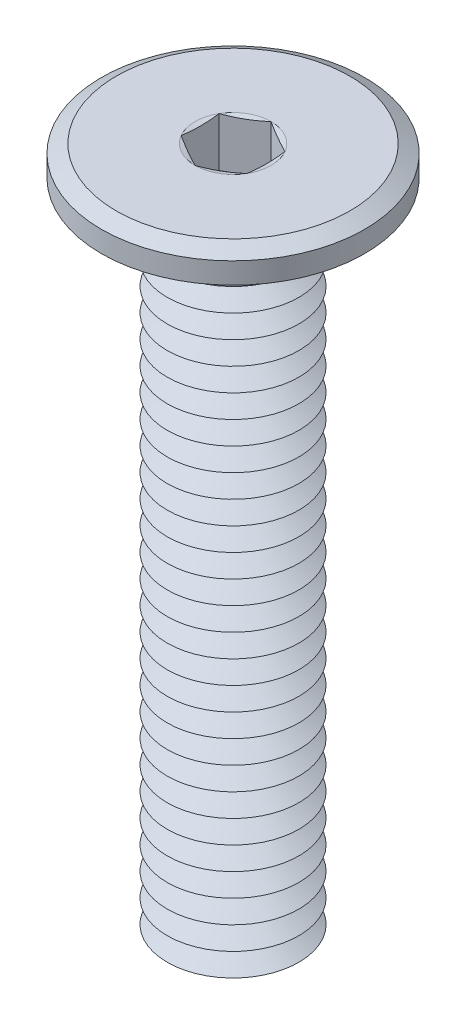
ISO-10303-21;
HEADER;
FILE_DESCRIPTION(('STEP AP214'),'2;1');
FILE_NAME('part.step','',(''),(''),'','','');
FILE_SCHEMA(('AUTOMOTIVE_DESIGN { 1 0 10303 214 1 1 1 1 }'));
ENDSEC;
DATA;
#1=APPLICATION_CONTEXT('core data for automotive mechanical design processes');
#2=APPLICATION_PROTOCOL_DEFINITION('international standard','automotive_design',2000,#1);
#3=PRODUCT_CONTEXT('',#1,'mechanical');
#4=PRODUCT('Part','Part','',(#3));
#5=PRODUCT_RELATED_PRODUCT_CATEGORY('part','',(#4));
#6=PRODUCT_DEFINITION_FORMATION('','',#4);
#7=PRODUCT_DEFINITION_CONTEXT('part definition',#1,'design');
#8=PRODUCT_DEFINITION('design','',#6,#7);
#9=PRODUCT_DEFINITION_SHAPE('','',#8);
#10=(LENGTH_UNIT() NAMED_UNIT(*) SI_UNIT(.MILLI.,.METRE.));
#11=(NAMED_UNIT(*) PLANE_ANGLE_UNIT() SI_UNIT($,.RADIAN.));
#12=(NAMED_UNIT(*) SI_UNIT($,.STERADIAN.) SOLID_ANGLE_UNIT());
#13=UNCERTAINTY_MEASURE_WITH_UNIT(LENGTH_MEASURE(1.E-05),#10,'distance_accuracy_value','');
#14=(GEOMETRIC_REPRESENTATION_CONTEXT(3) GLOBAL_UNCERTAINTY_ASSIGNED_CONTEXT((#13)) GLOBAL_UNIT_ASSIGNED_CONTEXT((#10,
#11,#12)) REPRESENTATION_CONTEXT('',''));
#15=CARTESIAN_POINT('',(0.,0.,0.));
#16=DIRECTION('',(0.,0.,1.));
#17=DIRECTION('',(1.,0.,0.));
#18=AXIS2_PLACEMENT_3D('',#15,#16,#17);
#19=CARTESIAN_POINT('',(0.,-19.85,0.));
#20=DIRECTION('',(0.,-1.,0.));
#21=DIRECTION('',(0.,0.,-1.));
#22=AXIS2_PLACEMENT_3D('',#19,#20,#21);
#23=CONICAL_SURFACE('',#22,2.,1.0471975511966);
#24=CARTESIAN_POINT('',(0.,-19.5,0.));
#25=DIRECTION('',(0.,1.,0.));
#26=DIRECTION('',(0.,0.,1.));
#27=AXIS2_PLACEMENT_3D('',#24,#25,#26);
#28=CIRCLE('',#27,1.39378221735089);
#29=CARTESIAN_POINT('',(0.,-19.5,1.39378221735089));
#30=VERTEX_POINT('',#29);
#31=EDGE_CURVE('E569',#30,#30,#28,.T.);
#32=ORIENTED_EDGE('',*,*,#31,.F.);
#33=EDGE_LOOP('',(#32));
#34=FACE_BOUND('',#33,.T.);
#35=CARTESIAN_POINT('',(0.,-19.85,0.));
#36=DIRECTION('',(0.,1.,0.));
#37=DIRECTION('',(0.,0.,1.));
#38=AXIS2_PLACEMENT_3D('',#35,#36,#37);
#39=CIRCLE('',#38,2.);
#40=CARTESIAN_POINT('',(0.,-19.85,2.));
#41=VERTEX_POINT('',#40);
#42=EDGE_CURVE('E572',#41,#41,#39,.T.);
#43=ORIENTED_EDGE('',*,*,#42,.T.);
#44=EDGE_LOOP('',(#43));
#45=FACE_BOUND('',#44,.T.);
#46=ADVANCED_FACE('F39',(#34,#45),#23,.T.);
#47=CARTESIAN_POINT('',(0.,-19.5,0.));
#48=DIRECTION('',(0.,1.,0.));
#49=DIRECTION('',(0.,0.,1.));
#50=AXIS2_PLACEMENT_3D('',#47,#48,#49);
#51=CONICAL_SURFACE('',#50,1.39378221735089,1.0471975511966);
#52=CARTESIAN_POINT('',(0.,-19.15,0.));
#53=DIRECTION('',(0.,1.,0.));
#54=DIRECTION('',(0.,0.,1.));
#55=AXIS2_PLACEMENT_3D('',#52,#53,#54);
#56=CIRCLE('',#55,2.);
#57=CARTESIAN_POINT('',(0.,-19.15,2.));
#58=VERTEX_POINT('',#57);
#59=EDGE_CURVE('E565',#58,#58,#56,.T.);
#60=ORIENTED_EDGE('',*,*,#59,.F.);
#61=EDGE_LOOP('',(#60));
#62=FACE_BOUND('',#61,.T.);
#63=ORIENTED_EDGE('',*,*,#31,.T.);
#64=EDGE_LOOP('',(#63));
#65=FACE_BOUND('',#64,.T.);
#66=ADVANCED_FACE('F232',(#62,#65),#51,.T.);
#67=CARTESIAN_POINT('',(0.,-20.9,0.));
#68=DIRECTION('',(0.,-1.,0.));
#69=DIRECTION('',(0.,0.,-1.));
#70=AXIS2_PLACEMENT_3D('',#67,#68,#69);
#71=PLANE('',#70);
#72=CARTESIAN_POINT('',(0.,-20.9,0.));
#73=DIRECTION('',(0.,1.,0.));
#74=DIRECTION('',(0.,0.,1.));
#75=AXIS2_PLACEMENT_3D('',#72,#73,#74);
#76=CIRCLE('',#75,1.39378221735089);
#77=CARTESIAN_POINT('',(0.,-20.9,1.39378221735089));
#78=VERTEX_POINT('',#77);
#79=EDGE_CURVE('E298',#78,#78,#76,.T.);
#80=ORIENTED_EDGE('',*,*,#79,.F.);
#81=EDGE_LOOP('',(#80));
#82=FACE_BOUND('',#81,.T.);
#83=ADVANCED_FACE('F238',(#82),#71,.T.);
#84=CARTESIAN_POINT('',(0.,-20.9,0.));
#85=DIRECTION('',(0.,1.,0.));
#86=DIRECTION('',(0.,0.,1.));
#87=AXIS2_PLACEMENT_3D('',#84,#85,#86);
#88=CONICAL_SURFACE('',#87,1.39378221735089,1.0471975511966);
#89=CARTESIAN_POINT('',(0.,-20.55,0.));
#90=DIRECTION('',(0.,1.,0.));
#91=DIRECTION('',(0.,0.,1.));
#92=AXIS2_PLACEMENT_3D('',#89,#90,#91);
#93=CIRCLE('',#92,2.);
#94=CARTESIAN_POINT('',(0.,-20.55,2.));
#95=VERTEX_POINT('',#94);
#96=EDGE_CURVE('E580',#95,#95,#93,.T.);
#97=ORIENTED_EDGE('',*,*,#96,.F.);
#98=EDGE_LOOP('',(#97));
#99=FACE_BOUND('',#98,.T.);
#100=ORIENTED_EDGE('',*,*,#79,.T.);
#101=EDGE_LOOP('',(#100));
#102=FACE_BOUND('',#101,.T.);
#103=ADVANCED_FACE('F253',(#99,#102),#88,.T.);
#104=CARTESIAN_POINT('',(0.,-20.55,0.));
#105=DIRECTION('',(0.,-1.,0.));
#106=DIRECTION('',(0.,0.,-1.));
#107=AXIS2_PLACEMENT_3D('',#104,#105,#106);
#108=CONICAL_SURFACE('',#107,2.,1.0471975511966);
#109=CARTESIAN_POINT('',(0.,-20.2,0.));
#110=DIRECTION('',(0.,1.,0.));
#111=DIRECTION('',(0.,0.,1.));
#112=AXIS2_PLACEMENT_3D('',#109,#110,#111);
#113=CIRCLE('',#112,1.39378221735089);
#114=CARTESIAN_POINT('',(0.,-20.2,1.39378221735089));
#115=VERTEX_POINT('',#114);
#116=EDGE_CURVE('E576',#115,#115,#113,.T.);
#117=ORIENTED_EDGE('',*,*,#116,.F.);
#118=EDGE_LOOP('',(#117));
#119=FACE_BOUND('',#118,.T.);
#120=ORIENTED_EDGE('',*,*,#96,.T.);
#121=EDGE_LOOP('',(#120));
#122=FACE_BOUND('',#121,.T.);
#123=ADVANCED_FACE('F249',(#119,#122),#108,.T.);
#124=CARTESIAN_POINT('',(0.,-20.2,0.));
#125=DIRECTION('',(0.,1.,0.));
#126=DIRECTION('',(0.,0.,1.));
#127=AXIS2_PLACEMENT_3D('',#124,#125,#126);
#128=CONICAL_SURFACE('',#127,1.39378221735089,1.0471975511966);
#129=ORIENTED_EDGE('',*,*,#42,.F.);
#130=EDGE_LOOP('',(#129));
#131=FACE_BOUND('',#130,.T.);
#132=ORIENTED_EDGE('',*,*,#116,.T.);
#133=EDGE_LOOP('',(#132));
#134=FACE_BOUND('',#133,.T.);
#135=ADVANCED_FACE('F245',(#131,#134),#128,.T.);
#136=CARTESIAN_POINT('',(0.,-19.15,0.));
#137=DIRECTION('',(0.,-1.,0.));
#138=DIRECTION('',(0.,0.,-1.));
#139=AXIS2_PLACEMENT_3D('',#136,#137,#138);
#140=CONICAL_SURFACE('',#139,2.,1.0471975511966);
#141=CARTESIAN_POINT('',(0.,-18.8,0.));
#142=DIRECTION('',(0.,1.,0.));
#143=DIRECTION('',(0.,0.,1.));
#144=AXIS2_PLACEMENT_3D('',#141,#142,#143);
#145=CIRCLE('',#144,1.39378221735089);
#146=CARTESIAN_POINT('',(0.,-18.8,1.39378221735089));
#147=VERTEX_POINT('',#146);
#148=EDGE_CURVE('E561',#147,#147,#145,.T.);
#149=ORIENTED_EDGE('',*,*,#148,.F.);
#150=EDGE_LOOP('',(#149));
#151=FACE_BOUND('',#150,.T.);
#152=ORIENTED_EDGE('',*,*,#59,.T.);
#153=EDGE_LOOP('',(#152));
#154=FACE_BOUND('',#153,.T.);
#155=ADVANCED_FACE('F248',(#151,#154),#140,.T.);
#156=CARTESIAN_POINT('',(0.,-18.8,0.));
#157=DIRECTION('',(0.,1.,0.));
#158=DIRECTION('',(0.,0.,1.));
#159=AXIS2_PLACEMENT_3D('',#156,#157,#158);
#160=CONICAL_SURFACE('',#159,1.39378221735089,1.0471975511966);
#161=CARTESIAN_POINT('',(0.,-18.45,0.));
#162=DIRECTION('',(0.,1.,0.));
#163=DIRECTION('',(0.,0.,1.));
#164=AXIS2_PLACEMENT_3D('',#161,#162,#163);
#165=CIRCLE('',#164,2.);
#166=CARTESIAN_POINT('',(0.,-18.45,2.));
#167=VERTEX_POINT('',#166);
#168=EDGE_CURVE('E557',#167,#167,#165,.T.);
#169=ORIENTED_EDGE('',*,*,#168,.F.);
#170=EDGE_LOOP('',(#169));
#171=FACE_BOUND('',#170,.T.);
#172=ORIENTED_EDGE('',*,*,#148,.T.);
#173=EDGE_LOOP('',(#172));
#174=FACE_BOUND('',#173,.T.);
#175=ADVANCED_FACE('F1092',(#171,#174),#160,.T.);
#176=CARTESIAN_POINT('',(0.,-18.45,0.));
#177=DIRECTION('',(0.,-1.,0.));
#178=DIRECTION('',(0.,0.,-1.));
#179=AXIS2_PLACEMENT_3D('',#176,#177,#178);
#180=CONICAL_SURFACE('',#179,2.,1.0471975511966);
#181=CARTESIAN_POINT('',(0.,-18.1,0.));
#182=DIRECTION('',(0.,1.,0.));
#183=DIRECTION('',(0.,0.,1.));
#184=AXIS2_PLACEMENT_3D('',#181,#182,#183);
#185=CIRCLE('',#184,1.39378221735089);
#186=CARTESIAN_POINT('',(0.,-18.1,1.39378221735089));
#187=VERTEX_POINT('',#186);
#188=EDGE_CURVE('E553',#187,#187,#185,.T.);
#189=ORIENTED_EDGE('',*,*,#188,.F.);
#190=EDGE_LOOP('',(#189));
#191=FACE_BOUND('',#190,.T.);
#192=ORIENTED_EDGE('',*,*,#168,.T.);
#193=EDGE_LOOP('',(#192));
#194=FACE_BOUND('',#193,.T.);
#195=ADVANCED_FACE('F1083',(#191,#194),#180,.T.);
#196=CARTESIAN_POINT('',(0.,-18.1,0.));
#197=DIRECTION('',(0.,1.,0.));
#198=DIRECTION('',(0.,0.,1.));
#199=AXIS2_PLACEMENT_3D('',#196,#197,#198);
#200=CONICAL_SURFACE('',#199,1.39378221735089,1.0471975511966);
#201=CARTESIAN_POINT('',(0.,-17.75,0.));
#202=DIRECTION('',(0.,1.,0.));
#203=DIRECTION('',(0.,0.,1.));
#204=AXIS2_PLACEMENT_3D('',#201,#202,#203);
#205=CIRCLE('',#204,2.);
#206=CARTESIAN_POINT('',(0.,-17.75,2.));
#207=VERTEX_POINT('',#206);
#208=EDGE_CURVE('E549',#207,#207,#205,.T.);
#209=ORIENTED_EDGE('',*,*,#208,.F.);
#210=EDGE_LOOP('',(#209));
#211=FACE_BOUND('',#210,.T.);
#212=ORIENTED_EDGE('',*,*,#188,.T.);
#213=EDGE_LOOP('',(#212));
#214=FACE_BOUND('',#213,.T.);
#215=ADVANCED_FACE('F1074',(#211,#214),#200,.T.);
#216=CARTESIAN_POINT('',(0.,-17.75,0.));
#217=DIRECTION('',(0.,-1.,0.));
#218=DIRECTION('',(0.,0.,-1.));
#219=AXIS2_PLACEMENT_3D('',#216,#217,#218);
#220=CONICAL_SURFACE('',#219,2.,1.0471975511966);
#221=CARTESIAN_POINT('',(0.,-17.4,0.));
#222=DIRECTION('',(0.,1.,0.));
#223=DIRECTION('',(0.,0.,1.));
#224=AXIS2_PLACEMENT_3D('',#221,#222,#223);
#225=CIRCLE('',#224,1.39378221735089);
#226=CARTESIAN_POINT('',(0.,-17.4,1.39378221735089));
#227=VERTEX_POINT('',#226);
#228=EDGE_CURVE('E545',#227,#227,#225,.T.);
#229=ORIENTED_EDGE('',*,*,#228,.F.);
#230=EDGE_LOOP('',(#229));
#231=FACE_BOUND('',#230,.T.);
#232=ORIENTED_EDGE('',*,*,#208,.T.);
#233=EDGE_LOOP('',(#232));
#234=FACE_BOUND('',#233,.T.);
#235=ADVANCED_FACE('F1065',(#231,#234),#220,.T.);
#236=CARTESIAN_POINT('',(0.,-17.4,0.));
#237=DIRECTION('',(0.,1.,0.));
#238=DIRECTION('',(0.,0.,1.));
#239=AXIS2_PLACEMENT_3D('',#236,#237,#238);
#240=CONICAL_SURFACE('',#239,1.39378221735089,1.0471975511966);
#241=CARTESIAN_POINT('',(0.,-17.05,0.));
#242=DIRECTION('',(0.,1.,0.));
#243=DIRECTION('',(0.,0.,1.));
#244=AXIS2_PLACEMENT_3D('',#241,#242,#243);
#245=CIRCLE('',#244,2.);
#246=CARTESIAN_POINT('',(0.,-17.05,2.));
#247=VERTEX_POINT('',#246);
#248=EDGE_CURVE('E541',#247,#247,#245,.T.);
#249=ORIENTED_EDGE('',*,*,#248,.F.);
#250=EDGE_LOOP('',(#249));
#251=FACE_BOUND('',#250,.T.);
#252=ORIENTED_EDGE('',*,*,#228,.T.);
#253=EDGE_LOOP('',(#252));
#254=FACE_BOUND('',#253,.T.);
#255=ADVANCED_FACE('F1056',(#251,#254),#240,.T.);
#256=CARTESIAN_POINT('',(0.,-17.05,0.));
#257=DIRECTION('',(0.,-1.,0.));
#258=DIRECTION('',(0.,0.,-1.));
#259=AXIS2_PLACEMENT_3D('',#256,#257,#258);
#260=CONICAL_SURFACE('',#259,2.,1.0471975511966);
#261=CARTESIAN_POINT('',(0.,-16.7,0.));
#262=DIRECTION('',(0.,1.,0.));
#263=DIRECTION('',(0.,0.,1.));
#264=AXIS2_PLACEMENT_3D('',#261,#262,#263);
#265=CIRCLE('',#264,1.39378221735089);
#266=CARTESIAN_POINT('',(0.,-16.7,1.39378221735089));
#267=VERTEX_POINT('',#266);
#268=EDGE_CURVE('E537',#267,#267,#265,.T.);
#269=ORIENTED_EDGE('',*,*,#268,.F.);
#270=EDGE_LOOP('',(#269));
#271=FACE_BOUND('',#270,.T.);
#272=ORIENTED_EDGE('',*,*,#248,.T.);
#273=EDGE_LOOP('',(#272));
#274=FACE_BOUND('',#273,.T.);
#275=ADVANCED_FACE('F1047',(#271,#274),#260,.T.);
#276=CARTESIAN_POINT('',(0.,-16.7,0.));
#277=DIRECTION('',(0.,1.,0.));
#278=DIRECTION('',(0.,0.,1.));
#279=AXIS2_PLACEMENT_3D('',#276,#277,#278);
#280=CONICAL_SURFACE('',#279,1.39378221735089,1.0471975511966);
#281=CARTESIAN_POINT('',(0.,-16.35,0.));
#282=DIRECTION('',(0.,1.,0.));
#283=DIRECTION('',(0.,0.,1.));
#284=AXIS2_PLACEMENT_3D('',#281,#282,#283);
#285=CIRCLE('',#284,2.);
#286=CARTESIAN_POINT('',(0.,-16.35,2.));
#287=VERTEX_POINT('',#286);
#288=EDGE_CURVE('E534',#287,#287,#285,.T.);
#289=ORIENTED_EDGE('',*,*,#288,.F.);
#290=EDGE_LOOP('',(#289));
#291=FACE_BOUND('',#290,.T.);
#292=ORIENTED_EDGE('',*,*,#268,.T.);
#293=EDGE_LOOP('',(#292));
#294=FACE_BOUND('',#293,.T.);
#295=ADVANCED_FACE('F1038',(#291,#294),#280,.T.);
#296=CARTESIAN_POINT('',(0.,-16.35,0.));
#297=DIRECTION('',(0.,-1.,0.));
#298=DIRECTION('',(0.,0.,-1.));
#299=AXIS2_PLACEMENT_3D('',#296,#297,#298);
#300=CONICAL_SURFACE('',#299,2.,1.0471975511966);
#301=CARTESIAN_POINT('',(0.,-16.,0.));
#302=DIRECTION('',(0.,1.,0.));
#303=DIRECTION('',(0.,0.,1.));
#304=AXIS2_PLACEMENT_3D('',#301,#302,#303);
#305=CIRCLE('',#304,1.39378221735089);
#306=CARTESIAN_POINT('',(0.,-16.,1.39378221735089));
#307=VERTEX_POINT('',#306);
#308=EDGE_CURVE('E530',#307,#307,#305,.T.);
#309=ORIENTED_EDGE('',*,*,#308,.F.);
#310=EDGE_LOOP('',(#309));
#311=FACE_BOUND('',#310,.T.);
#312=ORIENTED_EDGE('',*,*,#288,.T.);
#313=EDGE_LOOP('',(#312));
#314=FACE_BOUND('',#313,.T.);
#315=ADVANCED_FACE('F1029',(#311,#314),#300,.T.);
#316=CARTESIAN_POINT('',(0.,-16.,0.));
#317=DIRECTION('',(0.,1.,0.));
#318=DIRECTION('',(0.,0.,1.));
#319=AXIS2_PLACEMENT_3D('',#316,#317,#318);
#320=CONICAL_SURFACE('',#319,1.39378221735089,1.0471975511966);
#321=CARTESIAN_POINT('',(0.,-15.65,0.));
#322=DIRECTION('',(0.,1.,0.));
#323=DIRECTION('',(0.,0.,1.));
#324=AXIS2_PLACEMENT_3D('',#321,#322,#323);
#325=CIRCLE('',#324,2.);
#326=CARTESIAN_POINT('',(0.,-15.65,2.));
#327=VERTEX_POINT('',#326);
#328=EDGE_CURVE('E526',#327,#327,#325,.T.);
#329=ORIENTED_EDGE('',*,*,#328,.F.);
#330=EDGE_LOOP('',(#329));
#331=FACE_BOUND('',#330,.T.);
#332=ORIENTED_EDGE('',*,*,#308,.T.);
#333=EDGE_LOOP('',(#332));
#334=FACE_BOUND('',#333,.T.);
#335=ADVANCED_FACE('F1020',(#331,#334),#320,.T.);
#336=CARTESIAN_POINT('',(0.,-15.65,0.));
#337=DIRECTION('',(0.,-1.,0.));
#338=DIRECTION('',(0.,0.,-1.));
#339=AXIS2_PLACEMENT_3D('',#336,#337,#338);
#340=CONICAL_SURFACE('',#339,2.,1.0471975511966);
#341=CARTESIAN_POINT('',(0.,-15.3,0.));
#342=DIRECTION('',(0.,1.,0.));
#343=DIRECTION('',(0.,0.,1.));
#344=AXIS2_PLACEMENT_3D('',#341,#342,#343);
#345=CIRCLE('',#344,1.39378221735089);
#346=CARTESIAN_POINT('',(0.,-15.3,1.39378221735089));
#347=VERTEX_POINT('',#346);
#348=EDGE_CURVE('E522',#347,#347,#345,.T.);
#349=ORIENTED_EDGE('',*,*,#348,.F.);
#350=EDGE_LOOP('',(#349));
#351=FACE_BOUND('',#350,.T.);
#352=ORIENTED_EDGE('',*,*,#328,.T.);
#353=EDGE_LOOP('',(#352));
#354=FACE_BOUND('',#353,.T.);
#355=ADVANCED_FACE('F1011',(#351,#354),#340,.T.);
#356=CARTESIAN_POINT('',(0.,-15.3,0.));
#357=DIRECTION('',(0.,1.,0.));
#358=DIRECTION('',(0.,0.,1.));
#359=AXIS2_PLACEMENT_3D('',#356,#357,#358);
#360=CONICAL_SURFACE('',#359,1.39378221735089,1.0471975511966);
#361=CARTESIAN_POINT('',(0.,-14.95,0.));
#362=DIRECTION('',(0.,1.,0.));
#363=DIRECTION('',(0.,0.,1.));
#364=AXIS2_PLACEMENT_3D('',#361,#362,#363);
#365=CIRCLE('',#364,2.);
#366=CARTESIAN_POINT('',(0.,-14.95,2.));
#367=VERTEX_POINT('',#366);
#368=EDGE_CURVE('E518',#367,#367,#365,.T.);
#369=ORIENTED_EDGE('',*,*,#368,.F.);
#370=EDGE_LOOP('',(#369));
#371=FACE_BOUND('',#370,.T.);
#372=ORIENTED_EDGE('',*,*,#348,.T.);
#373=EDGE_LOOP('',(#372));
#374=FACE_BOUND('',#373,.T.);
#375=ADVANCED_FACE('F1002',(#371,#374),#360,.T.);
#376=CARTESIAN_POINT('',(0.,-14.95,0.));
#377=DIRECTION('',(0.,-1.,0.));
#378=DIRECTION('',(0.,0.,-1.));
#379=AXIS2_PLACEMENT_3D('',#376,#377,#378);
#380=CONICAL_SURFACE('',#379,2.,1.0471975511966);
#381=CARTESIAN_POINT('',(0.,-14.6,0.));
#382=DIRECTION('',(0.,1.,0.));
#383=DIRECTION('',(0.,0.,1.));
#384=AXIS2_PLACEMENT_3D('',#381,#382,#383);
#385=CIRCLE('',#384,1.39378221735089);
#386=CARTESIAN_POINT('',(0.,-14.6,1.39378221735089));
#387=VERTEX_POINT('',#386);
#388=EDGE_CURVE('E514',#387,#387,#385,.T.);
#389=ORIENTED_EDGE('',*,*,#388,.F.);
#390=EDGE_LOOP('',(#389));
#391=FACE_BOUND('',#390,.T.);
#392=ORIENTED_EDGE('',*,*,#368,.T.);
#393=EDGE_LOOP('',(#392));
#394=FACE_BOUND('',#393,.T.);
#395=ADVANCED_FACE('F993',(#391,#394),#380,.T.);
#396=CARTESIAN_POINT('',(0.,-14.6,0.));
#397=DIRECTION('',(0.,1.,0.));
#398=DIRECTION('',(0.,0.,1.));
#399=AXIS2_PLACEMENT_3D('',#396,#397,#398);
#400=CONICAL_SURFACE('',#399,1.39378221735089,1.0471975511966);
#401=CARTESIAN_POINT('',(0.,-14.25,0.));
#402=DIRECTION('',(0.,1.,0.));
#403=DIRECTION('',(0.,0.,1.));
#404=AXIS2_PLACEMENT_3D('',#401,#402,#403);
#405=CIRCLE('',#404,2.);
#406=CARTESIAN_POINT('',(0.,-14.25,2.));
#407=VERTEX_POINT('',#406);
#408=EDGE_CURVE('E510',#407,#407,#405,.T.);
#409=ORIENTED_EDGE('',*,*,#408,.F.);
#410=EDGE_LOOP('',(#409));
#411=FACE_BOUND('',#410,.T.);
#412=ORIENTED_EDGE('',*,*,#388,.T.);
#413=EDGE_LOOP('',(#412));
#414=FACE_BOUND('',#413,.T.);
#415=ADVANCED_FACE('F984',(#411,#414),#400,.T.);
#416=CARTESIAN_POINT('',(0.,-14.25,0.));
#417=DIRECTION('',(0.,-1.,0.));
#418=DIRECTION('',(0.,0.,-1.));
#419=AXIS2_PLACEMENT_3D('',#416,#417,#418);
#420=CONICAL_SURFACE('',#419,2.,1.0471975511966);
#421=CARTESIAN_POINT('',(0.,-13.9,0.));
#422=DIRECTION('',(0.,1.,0.));
#423=DIRECTION('',(0.,0.,1.));
#424=AXIS2_PLACEMENT_3D('',#421,#422,#423);
#425=CIRCLE('',#424,1.39378221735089);
#426=CARTESIAN_POINT('',(0.,-13.9,1.39378221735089));
#427=VERTEX_POINT('',#426);
#428=EDGE_CURVE('E506',#427,#427,#425,.T.);
#429=ORIENTED_EDGE('',*,*,#428,.F.);
#430=EDGE_LOOP('',(#429));
#431=FACE_BOUND('',#430,.T.);
#432=ORIENTED_EDGE('',*,*,#408,.T.);
#433=EDGE_LOOP('',(#432));
#434=FACE_BOUND('',#433,.T.);
#435=ADVANCED_FACE('F975',(#431,#434),#420,.T.);
#436=CARTESIAN_POINT('',(0.,-13.9,0.));
#437=DIRECTION('',(0.,1.,0.));
#438=DIRECTION('',(0.,0.,1.));
#439=AXIS2_PLACEMENT_3D('',#436,#437,#438);
#440=CONICAL_SURFACE('',#439,1.39378221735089,1.0471975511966);
#441=CARTESIAN_POINT('',(0.,-13.55,0.));
#442=DIRECTION('',(0.,1.,0.));
#443=DIRECTION('',(0.,0.,1.));
#444=AXIS2_PLACEMENT_3D('',#441,#442,#443);
#445=CIRCLE('',#444,2.);
#446=CARTESIAN_POINT('',(0.,-13.55,2.));
#447=VERTEX_POINT('',#446);
#448=EDGE_CURVE('E502',#447,#447,#445,.T.);
#449=ORIENTED_EDGE('',*,*,#448,.F.);
#450=EDGE_LOOP('',(#449));
#451=FACE_BOUND('',#450,.T.);
#452=ORIENTED_EDGE('',*,*,#428,.T.);
#453=EDGE_LOOP('',(#452));
#454=FACE_BOUND('',#453,.T.);
#455=ADVANCED_FACE('F966',(#451,#454),#440,.T.);
#456=CARTESIAN_POINT('',(0.,-13.55,0.));
#457=DIRECTION('',(0.,-1.,0.));
#458=DIRECTION('',(0.,0.,-1.));
#459=AXIS2_PLACEMENT_3D('',#456,#457,#458);
#460=CONICAL_SURFACE('',#459,2.,1.0471975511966);
#461=CARTESIAN_POINT('',(0.,-13.2,0.));
#462=DIRECTION('',(0.,1.,0.));
#463=DIRECTION('',(0.,0.,1.));
#464=AXIS2_PLACEMENT_3D('',#461,#462,#463);
#465=CIRCLE('',#464,1.39378221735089);
#466=CARTESIAN_POINT('',(0.,-13.2,1.39378221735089));
#467=VERTEX_POINT('',#466);
#468=EDGE_CURVE('E498',#467,#467,#465,.T.);
#469=ORIENTED_EDGE('',*,*,#468,.F.);
#470=EDGE_LOOP('',(#469));
#471=FACE_BOUND('',#470,.T.);
#472=ORIENTED_EDGE('',*,*,#448,.T.);
#473=EDGE_LOOP('',(#472));
#474=FACE_BOUND('',#473,.T.);
#475=ADVANCED_FACE('F957',(#471,#474),#460,.T.);
#476=CARTESIAN_POINT('',(0.,-13.2,0.));
#477=DIRECTION('',(0.,1.,0.));
#478=DIRECTION('',(0.,0.,1.));
#479=AXIS2_PLACEMENT_3D('',#476,#477,#478);
#480=CONICAL_SURFACE('',#479,1.39378221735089,1.0471975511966);
#481=CARTESIAN_POINT('',(0.,-12.85,0.));
#482=DIRECTION('',(0.,1.,0.));
#483=DIRECTION('',(0.,0.,1.));
#484=AXIS2_PLACEMENT_3D('',#481,#482,#483);
#485=CIRCLE('',#484,2.);
#486=CARTESIAN_POINT('',(0.,-12.85,2.));
#487=VERTEX_POINT('',#486);
#488=EDGE_CURVE('E495',#487,#487,#485,.T.);
#489=ORIENTED_EDGE('',*,*,#488,.F.);
#490=EDGE_LOOP('',(#489));
#491=FACE_BOUND('',#490,.T.);
#492=ORIENTED_EDGE('',*,*,#468,.T.);
#493=EDGE_LOOP('',(#492));
#494=FACE_BOUND('',#493,.T.);
#495=ADVANCED_FACE('F948',(#491,#494),#480,.T.);
#496=CARTESIAN_POINT('',(0.,-12.85,0.));
#497=DIRECTION('',(0.,-1.,0.));
#498=DIRECTION('',(0.,0.,-1.));
#499=AXIS2_PLACEMENT_3D('',#496,#497,#498);
#500=CONICAL_SURFACE('',#499,2.,1.0471975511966);
#501=CARTESIAN_POINT('',(0.,-12.5,0.));
#502=DIRECTION('',(0.,1.,0.));
#503=DIRECTION('',(0.,0.,1.));
#504=AXIS2_PLACEMENT_3D('',#501,#502,#503);
#505=CIRCLE('',#504,1.39378221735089);
#506=CARTESIAN_POINT('',(0.,-12.5,1.39378221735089));
#507=VERTEX_POINT('',#506);
#508=EDGE_CURVE('E491',#507,#507,#505,.T.);
#509=ORIENTED_EDGE('',*,*,#508,.F.);
#510=EDGE_LOOP('',(#509));
#511=FACE_BOUND('',#510,.T.);
#512=ORIENTED_EDGE('',*,*,#488,.T.);
#513=EDGE_LOOP('',(#512));
#514=FACE_BOUND('',#513,.T.);
#515=ADVANCED_FACE('F939',(#511,#514),#500,.T.);
#516=CARTESIAN_POINT('',(0.,-12.5,0.));
#517=DIRECTION('',(0.,1.,0.));
#518=DIRECTION('',(0.,0.,1.));
#519=AXIS2_PLACEMENT_3D('',#516,#517,#518);
#520=CONICAL_SURFACE('',#519,1.39378221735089,1.0471975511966);
#521=CARTESIAN_POINT('',(0.,-12.15,0.));
#522=DIRECTION('',(0.,1.,0.));
#523=DIRECTION('',(0.,0.,1.));
#524=AXIS2_PLACEMENT_3D('',#521,#522,#523);
#525=CIRCLE('',#524,2.);
#526=CARTESIAN_POINT('',(0.,-12.15,2.));
#527=VERTEX_POINT('',#526);
#528=EDGE_CURVE('E487',#527,#527,#525,.T.);
#529=ORIENTED_EDGE('',*,*,#528,.F.);
#530=EDGE_LOOP('',(#529));
#531=FACE_BOUND('',#530,.T.);
#532=ORIENTED_EDGE('',*,*,#508,.T.);
#533=EDGE_LOOP('',(#532));
#534=FACE_BOUND('',#533,.T.);
#535=ADVANCED_FACE('F930',(#531,#534),#520,.T.);
#536=CARTESIAN_POINT('',(0.,-12.15,0.));
#537=DIRECTION('',(0.,-1.,0.));
#538=DIRECTION('',(0.,0.,-1.));
#539=AXIS2_PLACEMENT_3D('',#536,#537,#538);
#540=CONICAL_SURFACE('',#539,2.,1.0471975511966);
#541=CARTESIAN_POINT('',(0.,-11.8,0.));
#542=DIRECTION('',(0.,1.,0.));
#543=DIRECTION('',(0.,0.,1.));
#544=AXIS2_PLACEMENT_3D('',#541,#542,#543);
#545=CIRCLE('',#544,1.39378221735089);
#546=CARTESIAN_POINT('',(0.,-11.8,1.39378221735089));
#547=VERTEX_POINT('',#546);
#548=EDGE_CURVE('E483',#547,#547,#545,.T.);
#549=ORIENTED_EDGE('',*,*,#548,.F.);
#550=EDGE_LOOP('',(#549));
#551=FACE_BOUND('',#550,.T.);
#552=ORIENTED_EDGE('',*,*,#528,.T.);
#553=EDGE_LOOP('',(#552));
#554=FACE_BOUND('',#553,.T.);
#555=ADVANCED_FACE('F921',(#551,#554),#540,.T.);
#556=CARTESIAN_POINT('',(0.,-11.8,0.));
#557=DIRECTION('',(0.,1.,0.));
#558=DIRECTION('',(0.,0.,1.));
#559=AXIS2_PLACEMENT_3D('',#556,#557,#558);
#560=CONICAL_SURFACE('',#559,1.39378221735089,1.0471975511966);
#561=CARTESIAN_POINT('',(0.,-11.45,0.));
#562=DIRECTION('',(0.,1.,0.));
#563=DIRECTION('',(0.,0.,1.));
#564=AXIS2_PLACEMENT_3D('',#561,#562,#563);
#565=CIRCLE('',#564,2.);
#566=CARTESIAN_POINT('',(0.,-11.45,2.));
#567=VERTEX_POINT('',#566);
#568=EDGE_CURVE('E479',#567,#567,#565,.T.);
#569=ORIENTED_EDGE('',*,*,#568,.F.);
#570=EDGE_LOOP('',(#569));
#571=FACE_BOUND('',#570,.T.);
#572=ORIENTED_EDGE('',*,*,#548,.T.);
#573=EDGE_LOOP('',(#572));
#574=FACE_BOUND('',#573,.T.);
#575=ADVANCED_FACE('F912',(#571,#574),#560,.T.);
#576=CARTESIAN_POINT('',(0.,-11.45,0.));
#577=DIRECTION('',(0.,-1.,0.));
#578=DIRECTION('',(0.,0.,-1.));
#579=AXIS2_PLACEMENT_3D('',#576,#577,#578);
#580=CONICAL_SURFACE('',#579,2.,1.0471975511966);
#581=CARTESIAN_POINT('',(0.,-11.1,0.));
#582=DIRECTION('',(0.,1.,0.));
#583=DIRECTION('',(0.,0.,1.));
#584=AXIS2_PLACEMENT_3D('',#581,#582,#583);
#585=CIRCLE('',#584,1.39378221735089);
#586=CARTESIAN_POINT('',(0.,-11.1,1.39378221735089));
#587=VERTEX_POINT('',#586);
#588=EDGE_CURVE('E475',#587,#587,#585,.T.);
#589=ORIENTED_EDGE('',*,*,#588,.F.);
#590=EDGE_LOOP('',(#589));
#591=FACE_BOUND('',#590,.T.);
#592=ORIENTED_EDGE('',*,*,#568,.T.);
#593=EDGE_LOOP('',(#592));
#594=FACE_BOUND('',#593,.T.);
#595=ADVANCED_FACE('F903',(#591,#594),#580,.T.);
#596=CARTESIAN_POINT('',(0.,-11.1,0.));
#597=DIRECTION('',(0.,1.,0.));
#598=DIRECTION('',(0.,0.,1.));
#599=AXIS2_PLACEMENT_3D('',#596,#597,#598);
#600=CONICAL_SURFACE('',#599,1.39378221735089,1.0471975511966);
#601=CARTESIAN_POINT('',(0.,-10.75,0.));
#602=DIRECTION('',(0.,1.,0.));
#603=DIRECTION('',(0.,0.,1.));
#604=AXIS2_PLACEMENT_3D('',#601,#602,#603);
#605=CIRCLE('',#604,2.);
#606=CARTESIAN_POINT('',(0.,-10.75,2.));
#607=VERTEX_POINT('',#606);
#608=EDGE_CURVE('E471',#607,#607,#605,.T.);
#609=ORIENTED_EDGE('',*,*,#608,.F.);
#610=EDGE_LOOP('',(#609));
#611=FACE_BOUND('',#610,.T.);
#612=ORIENTED_EDGE('',*,*,#588,.T.);
#613=EDGE_LOOP('',(#612));
#614=FACE_BOUND('',#613,.T.);
#615=ADVANCED_FACE('F894',(#611,#614),#600,.T.);
#616=CARTESIAN_POINT('',(0.,-10.75,0.));
#617=DIRECTION('',(0.,-1.,0.));
#618=DIRECTION('',(0.,0.,-1.));
#619=AXIS2_PLACEMENT_3D('',#616,#617,#618);
#620=CONICAL_SURFACE('',#619,2.,1.0471975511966);
#621=CARTESIAN_POINT('',(0.,-10.4,0.));
#622=DIRECTION('',(0.,1.,0.));
#623=DIRECTION('',(0.,0.,1.));
#624=AXIS2_PLACEMENT_3D('',#621,#622,#623);
#625=CIRCLE('',#624,1.39378221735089);
#626=CARTESIAN_POINT('',(0.,-10.4,1.39378221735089));
#627=VERTEX_POINT('',#626);
#628=EDGE_CURVE('E467',#627,#627,#625,.T.);
#629=ORIENTED_EDGE('',*,*,#628,.F.);
#630=EDGE_LOOP('',(#629));
#631=FACE_BOUND('',#630,.T.);
#632=ORIENTED_EDGE('',*,*,#608,.T.);
#633=EDGE_LOOP('',(#632));
#634=FACE_BOUND('',#633,.T.);
#635=ADVANCED_FACE('F885',(#631,#634),#620,.T.);
#636=CARTESIAN_POINT('',(0.,-10.4,0.));
#637=DIRECTION('',(0.,1.,0.));
#638=DIRECTION('',(0.,0.,1.));
#639=AXIS2_PLACEMENT_3D('',#636,#637,#638);
#640=CONICAL_SURFACE('',#639,1.39378221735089,1.0471975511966);
#641=CARTESIAN_POINT('',(0.,-10.05,0.));
#642=DIRECTION('',(0.,1.,0.));
#643=DIRECTION('',(0.,0.,1.));
#644=AXIS2_PLACEMENT_3D('',#641,#642,#643);
#645=CIRCLE('',#644,2.);
#646=CARTESIAN_POINT('',(0.,-10.05,2.));
#647=VERTEX_POINT('',#646);
#648=EDGE_CURVE('E464',#647,#647,#645,.T.);
#649=ORIENTED_EDGE('',*,*,#648,.F.);
#650=EDGE_LOOP('',(#649));
#651=FACE_BOUND('',#650,.T.);
#652=ORIENTED_EDGE('',*,*,#628,.T.);
#653=EDGE_LOOP('',(#652));
#654=FACE_BOUND('',#653,.T.);
#655=ADVANCED_FACE('F876',(#651,#654),#640,.T.);
#656=CARTESIAN_POINT('',(0.,-10.05,0.));
#657=DIRECTION('',(0.,-1.,0.));
#658=DIRECTION('',(0.,0.,-1.));
#659=AXIS2_PLACEMENT_3D('',#656,#657,#658);
#660=CONICAL_SURFACE('',#659,2.,1.0471975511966);
#661=CARTESIAN_POINT('',(0.,-9.7,0.));
#662=DIRECTION('',(0.,1.,0.));
#663=DIRECTION('',(0.,0.,1.));
#664=AXIS2_PLACEMENT_3D('',#661,#662,#663);
#665=CIRCLE('',#664,1.39378221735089);
#666=CARTESIAN_POINT('',(0.,-9.7,1.39378221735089));
#667=VERTEX_POINT('',#666);
#668=EDGE_CURVE('E460',#667,#667,#665,.T.);
#669=ORIENTED_EDGE('',*,*,#668,.F.);
#670=EDGE_LOOP('',(#669));
#671=FACE_BOUND('',#670,.T.);
#672=ORIENTED_EDGE('',*,*,#648,.T.);
#673=EDGE_LOOP('',(#672));
#674=FACE_BOUND('',#673,.T.);
#675=ADVANCED_FACE('F867',(#671,#674),#660,.T.);
#676=CARTESIAN_POINT('',(0.,-9.7,0.));
#677=DIRECTION('',(0.,1.,0.));
#678=DIRECTION('',(0.,0.,1.));
#679=AXIS2_PLACEMENT_3D('',#676,#677,#678);
#680=CONICAL_SURFACE('',#679,1.39378221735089,1.0471975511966);
#681=CARTESIAN_POINT('',(0.,-9.35,0.));
#682=DIRECTION('',(0.,1.,0.));
#683=DIRECTION('',(0.,0.,1.));
#684=AXIS2_PLACEMENT_3D('',#681,#682,#683);
#685=CIRCLE('',#684,2.);
#686=CARTESIAN_POINT('',(0.,-9.35,2.));
#687=VERTEX_POINT('',#686);
#688=EDGE_CURVE('E456',#687,#687,#685,.T.);
#689=ORIENTED_EDGE('',*,*,#688,.F.);
#690=EDGE_LOOP('',(#689));
#691=FACE_BOUND('',#690,.T.);
#692=ORIENTED_EDGE('',*,*,#668,.T.);
#693=EDGE_LOOP('',(#692));
#694=FACE_BOUND('',#693,.T.);
#695=ADVANCED_FACE('F858',(#691,#694),#680,.T.);
#696=CARTESIAN_POINT('',(0.,-9.35,0.));
#697=DIRECTION('',(0.,-1.,0.));
#698=DIRECTION('',(0.,0.,-1.));
#699=AXIS2_PLACEMENT_3D('',#696,#697,#698);
#700=CONICAL_SURFACE('',#699,2.,1.0471975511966);
#701=CARTESIAN_POINT('',(0.,-9.,0.));
#702=DIRECTION('',(0.,1.,0.));
#703=DIRECTION('',(0.,0.,1.));
#704=AXIS2_PLACEMENT_3D('',#701,#702,#703);
#705=CIRCLE('',#704,1.39378221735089);
#706=CARTESIAN_POINT('',(0.,-9.,1.39378221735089));
#707=VERTEX_POINT('',#706);
#708=EDGE_CURVE('E452',#707,#707,#705,.T.);
#709=ORIENTED_EDGE('',*,*,#708,.F.);
#710=EDGE_LOOP('',(#709));
#711=FACE_BOUND('',#710,.T.);
#712=ORIENTED_EDGE('',*,*,#688,.T.);
#713=EDGE_LOOP('',(#712));
#714=FACE_BOUND('',#713,.T.);
#715=ADVANCED_FACE('F849',(#711,#714),#700,.T.);
#716=CARTESIAN_POINT('',(0.,-9.,0.));
#717=DIRECTION('',(0.,1.,0.));
#718=DIRECTION('',(0.,0.,1.));
#719=AXIS2_PLACEMENT_3D('',#716,#717,#718);
#720=CONICAL_SURFACE('',#719,1.39378221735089,1.0471975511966);
#721=CARTESIAN_POINT('',(0.,-8.65,0.));
#722=DIRECTION('',(0.,1.,0.));
#723=DIRECTION('',(0.,0.,1.));
#724=AXIS2_PLACEMENT_3D('',#721,#722,#723);
#725=CIRCLE('',#724,2.);
#726=CARTESIAN_POINT('',(0.,-8.65,2.));
#727=VERTEX_POINT('',#726);
#728=EDGE_CURVE('E448',#727,#727,#725,.T.);
#729=ORIENTED_EDGE('',*,*,#728,.F.);
#730=EDGE_LOOP('',(#729));
#731=FACE_BOUND('',#730,.T.);
#732=ORIENTED_EDGE('',*,*,#708,.T.);
#733=EDGE_LOOP('',(#732));
#734=FACE_BOUND('',#733,.T.);
#735=ADVANCED_FACE('F840',(#731,#734),#720,.T.);
#736=CARTESIAN_POINT('',(0.,-8.65,0.));
#737=DIRECTION('',(0.,-1.,0.));
#738=DIRECTION('',(0.,0.,-1.));
#739=AXIS2_PLACEMENT_3D('',#736,#737,#738);
#740=CONICAL_SURFACE('',#739,2.,1.0471975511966);
#741=CARTESIAN_POINT('',(0.,-8.3,0.));
#742=DIRECTION('',(0.,1.,0.));
#743=DIRECTION('',(0.,0.,1.));
#744=AXIS2_PLACEMENT_3D('',#741,#742,#743);
#745=CIRCLE('',#744,1.39378221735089);
#746=CARTESIAN_POINT('',(0.,-8.3,1.39378221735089));
#747=VERTEX_POINT('',#746);
#748=EDGE_CURVE('E444',#747,#747,#745,.T.);
#749=ORIENTED_EDGE('',*,*,#748,.F.);
#750=EDGE_LOOP('',(#749));
#751=FACE_BOUND('',#750,.T.);
#752=ORIENTED_EDGE('',*,*,#728,.T.);
#753=EDGE_LOOP('',(#752));
#754=FACE_BOUND('',#753,.T.);
#755=ADVANCED_FACE('F831',(#751,#754),#740,.T.);
#756=CARTESIAN_POINT('',(0.,-8.3,0.));
#757=DIRECTION('',(0.,1.,0.));
#758=DIRECTION('',(0.,0.,1.));
#759=AXIS2_PLACEMENT_3D('',#756,#757,#758);
#760=CONICAL_SURFACE('',#759,1.39378221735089,1.0471975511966);
#761=CARTESIAN_POINT('',(0.,-7.95,0.));
#762=DIRECTION('',(0.,1.,0.));
#763=DIRECTION('',(0.,0.,1.));
#764=AXIS2_PLACEMENT_3D('',#761,#762,#763);
#765=CIRCLE('',#764,2.);
#766=CARTESIAN_POINT('',(0.,-7.95,2.));
#767=VERTEX_POINT('',#766);
#768=EDGE_CURVE('E441',#767,#767,#765,.T.);
#769=ORIENTED_EDGE('',*,*,#768,.F.);
#770=EDGE_LOOP('',(#769));
#771=FACE_BOUND('',#770,.T.);
#772=ORIENTED_EDGE('',*,*,#748,.T.);
#773=EDGE_LOOP('',(#772));
#774=FACE_BOUND('',#773,.T.);
#775=ADVANCED_FACE('F822',(#771,#774),#760,.T.);
#776=CARTESIAN_POINT('',(0.,-7.95,0.));
#777=DIRECTION('',(0.,-1.,0.));
#778=DIRECTION('',(0.,0.,-1.));
#779=AXIS2_PLACEMENT_3D('',#776,#777,#778);
#780=CONICAL_SURFACE('',#779,2.,1.0471975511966);
#781=CARTESIAN_POINT('',(0.,-7.6,0.));
#782=DIRECTION('',(0.,1.,0.));
#783=DIRECTION('',(0.,0.,1.));
#784=AXIS2_PLACEMENT_3D('',#781,#782,#783);
#785=CIRCLE('',#784,1.39378221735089);
#786=CARTESIAN_POINT('',(0.,-7.6,1.39378221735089));
#787=VERTEX_POINT('',#786);
#788=EDGE_CURVE('E437',#787,#787,#785,.T.);
#789=ORIENTED_EDGE('',*,*,#788,.F.);
#790=EDGE_LOOP('',(#789));
#791=FACE_BOUND('',#790,.T.);
#792=ORIENTED_EDGE('',*,*,#768,.T.);
#793=EDGE_LOOP('',(#792));
#794=FACE_BOUND('',#793,.T.);
#795=ADVANCED_FACE('F813',(#791,#794),#780,.T.);
#796=CARTESIAN_POINT('',(0.,-7.6,0.));
#797=DIRECTION('',(0.,1.,0.));
#798=DIRECTION('',(0.,0.,1.));
#799=AXIS2_PLACEMENT_3D('',#796,#797,#798);
#800=CONICAL_SURFACE('',#799,1.39378221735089,1.0471975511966);
#801=CARTESIAN_POINT('',(0.,-7.25,0.));
#802=DIRECTION('',(0.,1.,0.));
#803=DIRECTION('',(0.,0.,1.));
#804=AXIS2_PLACEMENT_3D('',#801,#802,#803);
#805=CIRCLE('',#804,2.);
#806=CARTESIAN_POINT('',(0.,-7.25,2.));
#807=VERTEX_POINT('',#806);
#808=EDGE_CURVE('E433',#807,#807,#805,.T.);
#809=ORIENTED_EDGE('',*,*,#808,.F.);
#810=EDGE_LOOP('',(#809));
#811=FACE_BOUND('',#810,.T.);
#812=ORIENTED_EDGE('',*,*,#788,.T.);
#813=EDGE_LOOP('',(#812));
#814=FACE_BOUND('',#813,.T.);
#815=ADVANCED_FACE('F804',(#811,#814),#800,.T.);
#816=CARTESIAN_POINT('',(0.,-7.25,0.));
#817=DIRECTION('',(0.,-1.,0.));
#818=DIRECTION('',(0.,0.,-1.));
#819=AXIS2_PLACEMENT_3D('',#816,#817,#818);
#820=CONICAL_SURFACE('',#819,2.,1.0471975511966);
#821=CARTESIAN_POINT('',(0.,-6.9,0.));
#822=DIRECTION('',(0.,1.,0.));
#823=DIRECTION('',(0.,0.,1.));
#824=AXIS2_PLACEMENT_3D('',#821,#822,#823);
#825=CIRCLE('',#824,1.39378221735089);
#826=CARTESIAN_POINT('',(0.,-6.9,1.39378221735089));
#827=VERTEX_POINT('',#826);
#828=EDGE_CURVE('E429',#827,#827,#825,.T.);
#829=ORIENTED_EDGE('',*,*,#828,.F.);
#830=EDGE_LOOP('',(#829));
#831=FACE_BOUND('',#830,.T.);
#832=ORIENTED_EDGE('',*,*,#808,.T.);
#833=EDGE_LOOP('',(#832));
#834=FACE_BOUND('',#833,.T.);
#835=ADVANCED_FACE('F795',(#831,#834),#820,.T.);
#836=CARTESIAN_POINT('',(0.,-6.9,0.));
#837=DIRECTION('',(0.,1.,0.));
#838=DIRECTION('',(0.,0.,1.));
#839=AXIS2_PLACEMENT_3D('',#836,#837,#838);
#840=CONICAL_SURFACE('',#839,1.39378221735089,1.0471975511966);
#841=CARTESIAN_POINT('',(0.,-6.55,0.));
#842=DIRECTION('',(0.,1.,0.));
#843=DIRECTION('',(0.,0.,1.));
#844=AXIS2_PLACEMENT_3D('',#841,#842,#843);
#845=CIRCLE('',#844,2.);
#846=CARTESIAN_POINT('',(0.,-6.55,2.));
#847=VERTEX_POINT('',#846);
#848=EDGE_CURVE('E425',#847,#847,#845,.T.);
#849=ORIENTED_EDGE('',*,*,#848,.F.);
#850=EDGE_LOOP('',(#849));
#851=FACE_BOUND('',#850,.T.);
#852=ORIENTED_EDGE('',*,*,#828,.T.);
#853=EDGE_LOOP('',(#852));
#854=FACE_BOUND('',#853,.T.);
#855=ADVANCED_FACE('F786',(#851,#854),#840,.T.);
#856=CARTESIAN_POINT('',(0.,-6.55,0.));
#857=DIRECTION('',(0.,-1.,0.));
#858=DIRECTION('',(0.,0.,-1.));
#859=AXIS2_PLACEMENT_3D('',#856,#857,#858);
#860=CONICAL_SURFACE('',#859,2.,1.0471975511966);
#861=CARTESIAN_POINT('',(0.,-6.2,0.));
#862=DIRECTION('',(0.,1.,0.));
#863=DIRECTION('',(0.,0.,1.));
#864=AXIS2_PLACEMENT_3D('',#861,#862,#863);
#865=CIRCLE('',#864,1.39378221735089);
#866=CARTESIAN_POINT('',(0.,-6.2,1.39378221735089));
#867=VERTEX_POINT('',#866);
#868=EDGE_CURVE('E421',#867,#867,#865,.T.);
#869=ORIENTED_EDGE('',*,*,#868,.F.);
#870=EDGE_LOOP('',(#869));
#871=FACE_BOUND('',#870,.T.);
#872=ORIENTED_EDGE('',*,*,#848,.T.);
#873=EDGE_LOOP('',(#872));
#874=FACE_BOUND('',#873,.T.);
#875=ADVANCED_FACE('F777',(#871,#874),#860,.T.);
#876=CARTESIAN_POINT('',(0.,-6.2,0.));
#877=DIRECTION('',(0.,1.,0.));
#878=DIRECTION('',(0.,0.,1.));
#879=AXIS2_PLACEMENT_3D('',#876,#877,#878);
#880=CONICAL_SURFACE('',#879,1.39378221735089,1.0471975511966);
#881=CARTESIAN_POINT('',(0.,-5.85,0.));
#882=DIRECTION('',(0.,1.,0.));
#883=DIRECTION('',(0.,0.,1.));
#884=AXIS2_PLACEMENT_3D('',#881,#882,#883);
#885=CIRCLE('',#884,2.);
#886=CARTESIAN_POINT('',(0.,-5.85,2.));
#887=VERTEX_POINT('',#886);
#888=EDGE_CURVE('E417',#887,#887,#885,.T.);
#889=ORIENTED_EDGE('',*,*,#888,.F.);
#890=EDGE_LOOP('',(#889));
#891=FACE_BOUND('',#890,.T.);
#892=ORIENTED_EDGE('',*,*,#868,.T.);
#893=EDGE_LOOP('',(#892));
#894=FACE_BOUND('',#893,.T.);
#895=ADVANCED_FACE('F768',(#891,#894),#880,.T.);
#896=CARTESIAN_POINT('',(0.,-5.85,0.));
#897=DIRECTION('',(0.,-1.,0.));
#898=DIRECTION('',(0.,0.,-1.));
#899=AXIS2_PLACEMENT_3D('',#896,#897,#898);
#900=CONICAL_SURFACE('',#899,2.,1.0471975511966);
#901=CARTESIAN_POINT('',(0.,-5.5,0.));
#902=DIRECTION('',(0.,1.,0.));
#903=DIRECTION('',(0.,0.,1.));
#904=AXIS2_PLACEMENT_3D('',#901,#902,#903);
#905=CIRCLE('',#904,1.39378221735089);
#906=CARTESIAN_POINT('',(0.,-5.5,1.39378221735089));
#907=VERTEX_POINT('',#906);
#908=EDGE_CURVE('E414',#907,#907,#905,.T.);
#909=ORIENTED_EDGE('',*,*,#908,.F.);
#910=EDGE_LOOP('',(#909));
#911=FACE_BOUND('',#910,.T.);
#912=ORIENTED_EDGE('',*,*,#888,.T.);
#913=EDGE_LOOP('',(#912));
#914=FACE_BOUND('',#913,.T.);
#915=ADVANCED_FACE('F759',(#911,#914),#900,.T.);
#916=CARTESIAN_POINT('',(0.,-5.5,0.));
#917=DIRECTION('',(0.,1.,0.));
#918=DIRECTION('',(0.,0.,1.));
#919=AXIS2_PLACEMENT_3D('',#916,#917,#918);
#920=CONICAL_SURFACE('',#919,1.39378221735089,1.0471975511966);
#921=CARTESIAN_POINT('',(0.,-5.15,0.));
#922=DIRECTION('',(0.,1.,0.));
#923=DIRECTION('',(0.,0.,1.));
#924=AXIS2_PLACEMENT_3D('',#921,#922,#923);
#925=CIRCLE('',#924,2.);
#926=CARTESIAN_POINT('',(0.,-5.15,2.));
#927=VERTEX_POINT('',#926);
#928=EDGE_CURVE('E410',#927,#927,#925,.T.);
#929=ORIENTED_EDGE('',*,*,#928,.F.);
#930=EDGE_LOOP('',(#929));
#931=FACE_BOUND('',#930,.T.);
#932=ORIENTED_EDGE('',*,*,#908,.T.);
#933=EDGE_LOOP('',(#932));
#934=FACE_BOUND('',#933,.T.);
#935=ADVANCED_FACE('F750',(#931,#934),#920,.T.);
#936=CARTESIAN_POINT('',(0.,-5.15,0.));
#937=DIRECTION('',(0.,-1.,0.));
#938=DIRECTION('',(0.,0.,-1.));
#939=AXIS2_PLACEMENT_3D('',#936,#937,#938);
#940=CONICAL_SURFACE('',#939,2.,1.0471975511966);
#941=CARTESIAN_POINT('',(0.,-4.8,0.));
#942=DIRECTION('',(0.,1.,0.));
#943=DIRECTION('',(0.,0.,1.));
#944=AXIS2_PLACEMENT_3D('',#941,#942,#943);
#945=CIRCLE('',#944,1.39378221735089);
#946=CARTESIAN_POINT('',(0.,-4.8,1.39378221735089));
#947=VERTEX_POINT('',#946);
#948=EDGE_CURVE('E406',#947,#947,#945,.T.);
#949=ORIENTED_EDGE('',*,*,#948,.F.);
#950=EDGE_LOOP('',(#949));
#951=FACE_BOUND('',#950,.T.);
#952=ORIENTED_EDGE('',*,*,#928,.T.);
#953=EDGE_LOOP('',(#952));
#954=FACE_BOUND('',#953,.T.);
#955=ADVANCED_FACE('F741',(#951,#954),#940,.T.);
#956=CARTESIAN_POINT('',(0.,-4.8,0.));
#957=DIRECTION('',(0.,1.,0.));
#958=DIRECTION('',(0.,0.,1.));
#959=AXIS2_PLACEMENT_3D('',#956,#957,#958);
#960=CONICAL_SURFACE('',#959,1.39378221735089,1.0471975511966);
#961=CARTESIAN_POINT('',(0.,-4.45,0.));
#962=DIRECTION('',(0.,1.,0.));
#963=DIRECTION('',(0.,0.,1.));
#964=AXIS2_PLACEMENT_3D('',#961,#962,#963);
#965=CIRCLE('',#964,2.);
#966=CARTESIAN_POINT('',(0.,-4.45,2.));
#967=VERTEX_POINT('',#966);
#968=EDGE_CURVE('E402',#967,#967,#965,.T.);
#969=ORIENTED_EDGE('',*,*,#968,.F.);
#970=EDGE_LOOP('',(#969));
#971=FACE_BOUND('',#970,.T.);
#972=ORIENTED_EDGE('',*,*,#948,.T.);
#973=EDGE_LOOP('',(#972));
#974=FACE_BOUND('',#973,.T.);
#975=ADVANCED_FACE('F732',(#971,#974),#960,.T.);
#976=CARTESIAN_POINT('',(0.,-4.45,0.));
#977=DIRECTION('',(0.,-1.,0.));
#978=DIRECTION('',(0.,0.,-1.));
#979=AXIS2_PLACEMENT_3D('',#976,#977,#978);
#980=CONICAL_SURFACE('',#979,2.,1.0471975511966);
#981=CARTESIAN_POINT('',(0.,-4.1,0.));
#982=DIRECTION('',(0.,1.,0.));
#983=DIRECTION('',(0.,0.,1.));
#984=AXIS2_PLACEMENT_3D('',#981,#982,#983);
#985=CIRCLE('',#984,1.39378221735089);
#986=CARTESIAN_POINT('',(0.,-4.1,1.39378221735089));
#987=VERTEX_POINT('',#986);
#988=EDGE_CURVE('E398',#987,#987,#985,.T.);
#989=ORIENTED_EDGE('',*,*,#988,.F.);
#990=EDGE_LOOP('',(#989));
#991=FACE_BOUND('',#990,.T.);
#992=ORIENTED_EDGE('',*,*,#968,.T.);
#993=EDGE_LOOP('',(#992));
#994=FACE_BOUND('',#993,.T.);
#995=ADVANCED_FACE('F723',(#991,#994),#980,.T.);
#996=CARTESIAN_POINT('',(0.,-4.1,0.));
#997=DIRECTION('',(0.,1.,0.));
#998=DIRECTION('',(0.,0.,1.));
#999=AXIS2_PLACEMENT_3D('',#996,#997,#998);
#1000=CONICAL_SURFACE('',#999,1.39378221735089,1.0471975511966);
#1001=CARTESIAN_POINT('',(0.,-3.75,0.));
#1002=DIRECTION('',(0.,1.,0.));
#1003=DIRECTION('',(0.,0.,1.));
#1004=AXIS2_PLACEMENT_3D('',#1001,#1002,#1003);
#1005=CIRCLE('',#1004,2.);
#1006=CARTESIAN_POINT('',(0.,-3.75,2.));
#1007=VERTEX_POINT('',#1006);
#1008=EDGE_CURVE('E394',#1007,#1007,#1005,.T.);
#1009=ORIENTED_EDGE('',*,*,#1008,.F.);
#1010=EDGE_LOOP('',(#1009));
#1011=FACE_BOUND('',#1010,.T.);
#1012=ORIENTED_EDGE('',*,*,#988,.T.);
#1013=EDGE_LOOP('',(#1012));
#1014=FACE_BOUND('',#1013,.T.);
#1015=ADVANCED_FACE('F714',(#1011,#1014),#1000,.T.);
#1016=CARTESIAN_POINT('',(0.,-3.75,0.));
#1017=DIRECTION('',(0.,-1.,0.));
#1018=DIRECTION('',(0.,0.,-1.));
#1019=AXIS2_PLACEMENT_3D('',#1016,#1017,#1018);
#1020=CONICAL_SURFACE('',#1019,2.,1.0471975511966);
#1021=CARTESIAN_POINT('',(0.,-3.4,0.));
#1022=DIRECTION('',(0.,1.,0.));
#1023=DIRECTION('',(0.,0.,1.));
#1024=AXIS2_PLACEMENT_3D('',#1021,#1022,#1023);
#1025=CIRCLE('',#1024,1.39378221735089);
#1026=CARTESIAN_POINT('',(0.,-3.4,1.39378221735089));
#1027=VERTEX_POINT('',#1026);
#1028=EDGE_CURVE('E390',#1027,#1027,#1025,.T.);
#1029=ORIENTED_EDGE('',*,*,#1028,.F.);
#1030=EDGE_LOOP('',(#1029));
#1031=FACE_BOUND('',#1030,.T.);
#1032=ORIENTED_EDGE('',*,*,#1008,.T.);
#1033=EDGE_LOOP('',(#1032));
#1034=FACE_BOUND('',#1033,.T.);
#1035=ADVANCED_FACE('F705',(#1031,#1034),#1020,.T.);
#1036=CARTESIAN_POINT('',(0.,-3.4,0.));
#1037=DIRECTION('',(0.,1.,0.));
#1038=DIRECTION('',(0.,0.,1.));
#1039=AXIS2_PLACEMENT_3D('',#1036,#1037,#1038);
#1040=CONICAL_SURFACE('',#1039,1.39378221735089,1.0471975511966);
#1041=CARTESIAN_POINT('',(0.,-3.05,0.));
#1042=DIRECTION('',(0.,1.,0.));
#1043=DIRECTION('',(0.,0.,1.));
#1044=AXIS2_PLACEMENT_3D('',#1041,#1042,#1043);
#1045=CIRCLE('',#1044,2.);
#1046=CARTESIAN_POINT('',(0.,-3.05,2.));
#1047=VERTEX_POINT('',#1046);
#1048=EDGE_CURVE('E386',#1047,#1047,#1045,.T.);
#1049=ORIENTED_EDGE('',*,*,#1048,.F.);
#1050=EDGE_LOOP('',(#1049));
#1051=FACE_BOUND('',#1050,.T.);
#1052=ORIENTED_EDGE('',*,*,#1028,.T.);
#1053=EDGE_LOOP('',(#1052));
#1054=FACE_BOUND('',#1053,.T.);
#1055=ADVANCED_FACE('F696',(#1051,#1054),#1040,.T.);
#1056=CARTESIAN_POINT('',(0.,-3.05,0.));
#1057=DIRECTION('',(0.,-1.,0.));
#1058=DIRECTION('',(0.,0.,-1.));
#1059=AXIS2_PLACEMENT_3D('',#1056,#1057,#1058);
#1060=CONICAL_SURFACE('',#1059,2.,1.0471975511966);
#1061=CARTESIAN_POINT('',(0.,-2.7,0.));
#1062=DIRECTION('',(0.,1.,0.));
#1063=DIRECTION('',(0.,0.,1.));
#1064=AXIS2_PLACEMENT_3D('',#1061,#1062,#1063);
#1065=CIRCLE('',#1064,1.39378221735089);
#1066=CARTESIAN_POINT('',(0.,-2.7,1.39378221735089));
#1067=VERTEX_POINT('',#1066);
#1068=EDGE_CURVE('E382',#1067,#1067,#1065,.T.);
#1069=ORIENTED_EDGE('',*,*,#1068,.F.);
#1070=EDGE_LOOP('',(#1069));
#1071=FACE_BOUND('',#1070,.T.);
#1072=ORIENTED_EDGE('',*,*,#1048,.T.);
#1073=EDGE_LOOP('',(#1072));
#1074=FACE_BOUND('',#1073,.T.);
#1075=ADVANCED_FACE('F687',(#1071,#1074),#1060,.T.);
#1076=CARTESIAN_POINT('',(0.,-2.7,0.));
#1077=DIRECTION('',(0.,1.,0.));
#1078=DIRECTION('',(0.,0.,1.));
#1079=AXIS2_PLACEMENT_3D('',#1076,#1077,#1078);
#1080=CONICAL_SURFACE('',#1079,1.39378221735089,1.0471975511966);
#1081=CARTESIAN_POINT('',(0.,-2.35,0.));
#1082=DIRECTION('',(0.,1.,0.));
#1083=DIRECTION('',(0.,0.,1.));
#1084=AXIS2_PLACEMENT_3D('',#1081,#1082,#1083);
#1085=CIRCLE('',#1084,2.);
#1086=CARTESIAN_POINT('',(0.,-2.35,2.));
#1087=VERTEX_POINT('',#1086);
#1088=EDGE_CURVE('E367',#1087,#1087,#1085,.T.);
#1089=ORIENTED_EDGE('',*,*,#1088,.F.);
#1090=EDGE_LOOP('',(#1089));
#1091=FACE_BOUND('',#1090,.T.);
#1092=ORIENTED_EDGE('',*,*,#1068,.T.);
#1093=EDGE_LOOP('',(#1092));
#1094=FACE_BOUND('',#1093,.T.);
#1095=ADVANCED_FACE('F273',(#1091,#1094),#1080,.T.);
#1096=CARTESIAN_POINT('',(0.,0.,0.));
#1097=DIRECTION('',(0.,1.,0.));
#1098=DIRECTION('',(0.,0.,1.));
#1099=AXIS2_PLACEMENT_3D('',#1096,#1097,#1098);
#1100=PLANE('',#1099);
#1101=CARTESIAN_POINT('',(0.,0.,0.));
#1102=DIRECTION('',(0.,1.,0.));
#1103=DIRECTION('',(0.,0.,1.));
#1104=AXIS2_PLACEMENT_3D('',#1101,#1102,#1103);
#1105=CIRCLE('',#1104,1.15470053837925);
#1106=CARTESIAN_POINT('',(0.,0.,1.15470053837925));
#1107=VERTEX_POINT('',#1106);
#1108=CARTESIAN_POINT('',(1.,0.,0.577350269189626));
#1109=VERTEX_POINT('',#1108);
#1110=EDGE_CURVE('E66',#1107,#1109,#1105,.T.);
#1111=ORIENTED_EDGE('',*,*,#1110,.F.);
#1112=CARTESIAN_POINT('',(-1.,0.,0.577350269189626));
#1113=VERTEX_POINT('',#1112);
#1114=EDGE_CURVE('E169',#1113,#1107,#1105,.T.);
#1115=ORIENTED_EDGE('',*,*,#1114,.F.);
#1116=CARTESIAN_POINT('',(-1.,0.,-0.577350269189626));
#1117=VERTEX_POINT('',#1116);
#1118=EDGE_CURVE('E164',#1117,#1113,#1105,.T.);
#1119=ORIENTED_EDGE('',*,*,#1118,.F.);
#1120=CARTESIAN_POINT('',(0.,0.,-1.15470053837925));
#1121=VERTEX_POINT('',#1120);
#1122=EDGE_CURVE('E128',#1121,#1117,#1105,.T.);
#1123=ORIENTED_EDGE('',*,*,#1122,.F.);
#1124=CARTESIAN_POINT('',(1.,0.,-0.577350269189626));
#1125=VERTEX_POINT('',#1124);
#1126=EDGE_CURVE('E119',#1125,#1121,#1105,.T.);
#1127=ORIENTED_EDGE('',*,*,#1126,.F.);
#1128=EDGE_CURVE('E59',#1109,#1125,#1105,.T.);
#1129=ORIENTED_EDGE('',*,*,#1128,.F.);
#1130=EDGE_LOOP('',(#1111,#1115,#1119,#1123,#1127,#1129));
#1131=FACE_BOUND('',#1130,.T.);
#1132=CARTESIAN_POINT('',(0.,0.,0.));
#1133=DIRECTION('',(0.,1.,0.));
#1134=DIRECTION('',(0.,0.,1.));
#1135=AXIS2_PLACEMENT_3D('',#1132,#1133,#1134);
#1136=CIRCLE('',#1135,3.55);
#1137=CARTESIAN_POINT('',(0.,0.,3.55));
#1138=VERTEX_POINT('',#1137);
#1139=EDGE_CURVE('E294',#1138,#1138,#1136,.T.);
#1140=ORIENTED_EDGE('',*,*,#1139,.T.);
#1141=EDGE_LOOP('',(#1140));
#1142=FACE_BOUND('',#1141,.T.);
#1143=ADVANCED_FACE('F160',(#1131,#1142),#1100,.T.);
#1144=CARTESIAN_POINT('',(0.,-0.9,0.));
#1145=DIRECTION('',(0.,1.,0.));
#1146=DIRECTION('',(0.,0.,1.));
#1147=AXIS2_PLACEMENT_3D('',#1144,#1145,#1146);
#1148=CYLINDRICAL_SURFACE('',#1147,4.);
#1149=CARTESIAN_POINT('',(0.,-0.259807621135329,0.));
#1150=DIRECTION('',(0.,1.,0.));
#1151=DIRECTION('',(0.,0.,1.));
#1152=AXIS2_PLACEMENT_3D('',#1149,#1150,#1151);
#1153=CIRCLE('',#1152,4.);
#1154=CARTESIAN_POINT('',(0.,-0.259807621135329,4.));
#1155=VERTEX_POINT('',#1154);
#1156=EDGE_CURVE('E305',#1155,#1155,#1153,.F.);
#1157=ORIENTED_EDGE('',*,*,#1156,.T.);
#1158=EDGE_LOOP('',(#1157));
#1159=FACE_BOUND('',#1158,.T.);
#1160=CARTESIAN_POINT('',(0.,-0.9,0.));
#1161=DIRECTION('',(0.,1.,0.));
#1162=DIRECTION('',(0.,0.,1.));
#1163=AXIS2_PLACEMENT_3D('',#1160,#1161,#1162);
#1164=CIRCLE('',#1163,4.);
#1165=CARTESIAN_POINT('',(0.,-0.9,4.));
#1166=VERTEX_POINT('',#1165);
#1167=EDGE_CURVE('E290',#1166,#1166,#1164,.T.);
#1168=ORIENTED_EDGE('',*,*,#1167,.T.);
#1169=EDGE_LOOP('',(#1168));
#1170=FACE_BOUND('',#1169,.T.);
#1171=ADVANCED_FACE('F269',(#1159,#1170),#1148,.T.);
#1172=CARTESIAN_POINT('',(0.,-0.9,0.));
#1173=DIRECTION('',(0.,1.,0.));
#1174=DIRECTION('',(0.,0.,1.));
#1175=AXIS2_PLACEMENT_3D('',#1172,#1173,#1174);
#1176=PLANE('',#1175);
#1177=CARTESIAN_POINT('',(0.,-0.9,0.));
#1178=DIRECTION('',(0.,1.,0.));
#1179=DIRECTION('',(0.,0.,1.));
#1180=AXIS2_PLACEMENT_3D('',#1177,#1178,#1179);
#1181=CIRCLE('',#1180,2.2);
#1182=CARTESIAN_POINT('',(0.,-0.9,2.2));
#1183=VERTEX_POINT('',#1182);
#1184=EDGE_CURVE('E285',#1183,#1183,#1181,.T.);
#1185=ORIENTED_EDGE('',*,*,#1184,.T.);
#1186=EDGE_LOOP('',(#1185));
#1187=FACE_BOUND('',#1186,.T.);
#1188=ORIENTED_EDGE('',*,*,#1167,.F.);
#1189=EDGE_LOOP('',(#1188));
#1190=FACE_BOUND('',#1189,.T.);
#1191=ADVANCED_FACE('F265',(#1187,#1190),#1176,.F.);
#1192=CARTESIAN_POINT('',(0.,-20.9,0.));
#1193=DIRECTION('',(0.,1.,0.));
#1194=DIRECTION('',(0.,0.,1.));
#1195=AXIS2_PLACEMENT_3D('',#1192,#1193,#1194);
#1196=CYLINDRICAL_SURFACE('',#1195,2.);
#1197=CARTESIAN_POINT('',(0.,-1.1,0.));
#1198=DIRECTION('',(0.,1.,0.));
#1199=DIRECTION('',(0.,0.,1.));
#1200=AXIS2_PLACEMENT_3D('',#1197,#1198,#1199);
#1201=CIRCLE('',#1200,2.);
#1202=CARTESIAN_POINT('',(0.,-1.1,2.));
#1203=VERTEX_POINT('',#1202);
#1204=EDGE_CURVE('E288',#1203,#1203,#1201,.F.);
#1205=ORIENTED_EDGE('',*,*,#1204,.T.);
#1206=EDGE_LOOP('',(#1205));
#1207=FACE_BOUND('',#1206,.T.);
#1208=ORIENTED_EDGE('',*,*,#1088,.T.);
#1209=EDGE_LOOP('',(#1208));
#1210=FACE_BOUND('',#1209,.T.);
#1211=ADVANCED_FACE('F261',(#1207,#1210),#1196,.T.);
#1212=CARTESIAN_POINT('',(0.,-1.1,0.));
#1213=DIRECTION('',(0.,1.,0.));
#1214=DIRECTION('',(0.,0.,1.));
#1215=AXIS2_PLACEMENT_3D('',#1212,#1213,#1214);
#1216=TOROIDAL_SURFACE('',#1215,2.2,0.2);
#1217=ORIENTED_EDGE('',*,*,#1184,.F.);
#1218=EDGE_LOOP('',(#1217));
#1219=FACE_BOUND('',#1218,.T.);
#1220=ORIENTED_EDGE('',*,*,#1204,.F.);
#1221=EDGE_LOOP('',(#1220));
#1222=FACE_BOUND('',#1221,.T.);
#1223=ADVANCED_FACE('F264',(#1219,#1222),#1216,.F.);
#1224=CARTESIAN_POINT('',(0.,0.,0.));
#1225=DIRECTION('',(0.,-1.,0.));
#1226=DIRECTION('',(0.,0.,-1.));
#1227=AXIS2_PLACEMENT_3D('',#1224,#1225,#1226);
#1228=CONICAL_SURFACE('',#1227,3.55,1.0471975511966);
#1229=ORIENTED_EDGE('',*,*,#1156,.F.);
#1230=EDGE_LOOP('',(#1229));
#1231=FACE_BOUND('',#1230,.T.);
#1232=ORIENTED_EDGE('',*,*,#1139,.F.);
#1233=EDGE_LOOP('',(#1232));
#1234=FACE_BOUND('',#1233,.T.);
#1235=ADVANCED_FACE('F41',(#1231,#1234),#1228,.T.);
#1236=CARTESIAN_POINT('',(0.,0.,0.));
#1237=DIRECTION('',(0.,1.,0.));
#1238=DIRECTION('',(0.,0.,1.));
#1239=AXIS2_PLACEMENT_3D('',#1236,#1237,#1238);
#1240=CONICAL_SURFACE('',#1239,1.15470053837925,1.30899693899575);
#1241=ORIENTED_EDGE('',*,*,#1122,.T.);
#1242=CARTESIAN_POINT('',(0.000200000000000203,3.09447482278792E-05,-1.15481600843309));
#1243=CARTESIAN_POINT('',(-0.0413440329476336,-0.00640029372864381,-1.13083054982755));
#1244=CARTESIAN_POINT('',(-0.0829634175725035,-0.012238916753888,-1.10680158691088));
#1245=CARTESIAN_POINT('',(-0.166349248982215,-0.0224969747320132,-1.05865875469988));
#1246=CARTESIAN_POINT('',(-0.208115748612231,-0.0269158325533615,-1.03454485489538));
#1247=CARTESIAN_POINT('',(-0.291542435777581,-0.0340762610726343,-0.986378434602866));
#1248=CARTESIAN_POINT('',(-0.333202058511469,-0.0368263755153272,-0.962326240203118));
#1249=CARTESIAN_POINT('',(-0.416574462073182,-0.0405140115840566,-0.914191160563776));
#1250=CARTESIAN_POINT('',(-0.458287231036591,-0.0414518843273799,-0.890108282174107));
#1251=CARTESIAN_POINT('',(-0.541712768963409,-0.0414518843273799,-0.84194252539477));
#1252=CARTESIAN_POINT('',(-0.583425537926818,-0.0405140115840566,-0.817859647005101));
#1253=CARTESIAN_POINT('',(-0.666797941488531,-0.0368263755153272,-0.76972456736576));
#1254=CARTESIAN_POINT('',(-0.708457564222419,-0.0340762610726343,-0.745672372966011));
#1255=CARTESIAN_POINT('',(-0.791884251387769,-0.0269158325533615,-0.697505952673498));
#1256=CARTESIAN_POINT('',(-0.833650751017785,-0.0224969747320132,-0.673392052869));
#1257=CARTESIAN_POINT('',(-0.917036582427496,-0.012238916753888,-0.625249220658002));
#1258=CARTESIAN_POINT('',(-0.958655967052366,-0.00640029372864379,-0.601220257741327));
#1259=CARTESIAN_POINT('',(-1.0002,3.09447482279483E-05,-0.577234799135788));
#1260=B_SPLINE_CURVE_WITH_KNOTS('',3,(#1242,#1243,#1244,#1245,#1246,#1247,#1248,#1249,#1250,
#1251,#1252,#1253,#1254,#1255,#1256,#1257,#1258,#1259),.UNSPECIFIED.,.F.,.F.,(4,2,2,2,2,2,2,2,
4),(0.,0.145207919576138,0.290474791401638,0.434991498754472,0.579480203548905,
0.723968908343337,0.868485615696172,1.01375248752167,1.15896040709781),.UNSPECIFIED.);
#1261=EDGE_CURVE('E11',#1121,#1117,#1260,.T.);
#1262=ORIENTED_EDGE('',*,*,#1261,.F.);
#1263=EDGE_LOOP('',(#1241,#1262));
#1264=FACE_BOUND('',#1263,.T.);
#1265=ADVANCED_FACE('F132',(#1264),#1240,.F.);
#1266=ORIENTED_EDGE('',*,*,#1118,.T.);
#1267=CARTESIAN_POINT('',(-1.,0.236023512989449,-1.77298423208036));
#1268=CARTESIAN_POINT('',(-1.,0.216107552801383,-1.6875314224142));
#1269=CARTESIAN_POINT('',(-1.,0.196471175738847,-1.60200905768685));
#1270=CARTESIAN_POINT('',(-1.,0.158144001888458,-1.43073686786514));
#1271=CARTESIAN_POINT('',(-1.,0.139453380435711,-1.34498700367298));
#1272=CARTESIAN_POINT('',(-1.,0.1032364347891,-1.17236724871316));
#1273=CARTESIAN_POINT('',(-1.,0.0857232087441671,-1.08549457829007));
#1274=CARTESIAN_POINT('',(-1.,0.0527507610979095,-0.911344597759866));
#1275=CARTESIAN_POINT('',(-1.,0.0372917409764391,-0.824067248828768));
#1276=CARTESIAN_POINT('',(-1.,0.00985747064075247,-0.651412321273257));
#1277=CARTESIAN_POINT('',(-1.,-0.00220187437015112,-0.566048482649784));
#1278=CARTESIAN_POINT('',(-1.,-0.0220616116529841,-0.394830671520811));
#1279=CARTESIAN_POINT('',(-1.,-0.0298633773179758,-0.308976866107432));
#1280=CARTESIAN_POINT('',(-1.,-0.0398601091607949,-0.137316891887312));
#1281=CARTESIAN_POINT('',(-1.,-0.0420806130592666,-0.0515123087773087));
#1282=CARTESIAN_POINT('',(-1.,-0.0405086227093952,0.120045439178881));
#1283=CARTESIAN_POINT('',(-1.,-0.0367157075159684,0.20579860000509));
#1284=CARTESIAN_POINT('',(-1.,-0.0256781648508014,0.353235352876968));
#1285=CARTESIAN_POINT('',(-1.,-0.0196775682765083,0.415019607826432));
#1286=CARTESIAN_POINT('',(-1.,-0.00545724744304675,0.538326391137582));
#1287=CARTESIAN_POINT('',(-1.,0.00276242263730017,0.599848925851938));
#1288=CARTESIAN_POINT('',(-1.,0.0300253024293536,0.784439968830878));
#1289=CARTESIAN_POINT('',(-1.,0.0516350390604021,0.907124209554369));
#1290=CARTESIAN_POINT('',(-1.,0.0871575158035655,1.09186138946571));
#1291=CARTESIAN_POINT('',(-1.,0.0996614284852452,1.15420316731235));
#1292=CARTESIAN_POINT('',(-1.,0.125434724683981,1.27873123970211));
#1293=CARTESIAN_POINT('',(-1.,0.138704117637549,1.34091753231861));
#1294=CARTESIAN_POINT('',(-1.,0.165737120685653,1.4648085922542));
#1295=CARTESIAN_POINT('',(-1.,0.179497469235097,1.5265140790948));
#1296=CARTESIAN_POINT('',(-1.,0.207459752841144,1.64982040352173));
#1297=CARTESIAN_POINT('',(-1.,0.221661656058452,1.71142124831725));
#1298=CARTESIAN_POINT('',(-1.,0.236023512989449,1.77298423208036));
#1299=B_SPLINE_CURVE_WITH_KNOTS('',3,(#1267,#1268,#1269,#1270,#1271,#1272,#1273,#1274,#1275,
#1276,#1277,#1278,#1279,#1280,#1281,#1282,#1283,#1284,#1285,#1286,#1287,#1288,#1289,#1290,#1291,
#1292,#1293,#1294,#1295,#1296,#1297,#1298),.UNSPECIFIED.,.F.,.F.,(4,2,2,2,2,2,2,2,2,2,2,2,2,2,2,
4),(0.,0.263234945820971,0.52651851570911,0.792363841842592,1.0582352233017,1.31679695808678,
1.5752752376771,1.83256864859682,2.08988007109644,2.27606085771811,2.462237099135,
2.83581575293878,3.02656672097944,3.21732004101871,3.40698211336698,3.59663054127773),.UNSPECIFIED.);
#1300=EDGE_CURVE('E172',#1117,#1113,#1299,.T.);
#1301=ORIENTED_EDGE('',*,*,#1300,.F.);
#1302=EDGE_LOOP('',(#1266,#1301));
#1303=FACE_BOUND('',#1302,.T.);
#1304=ADVANCED_FACE('F643',(#1303),#1240,.F.);
#1305=ORIENTED_EDGE('',*,*,#1114,.T.);
#1306=CARTESIAN_POINT('',(-1.0002,3.09447482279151E-05,0.577234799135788));
#1307=CARTESIAN_POINT('',(-0.958655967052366,-0.00640029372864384,0.601220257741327));
#1308=CARTESIAN_POINT('',(-0.917036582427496,-0.012238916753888,0.625249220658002));
#1309=CARTESIAN_POINT('',(-0.833650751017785,-0.0224969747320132,0.673392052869));
#1310=CARTESIAN_POINT('',(-0.791884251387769,-0.0269158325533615,0.697505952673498));
#1311=CARTESIAN_POINT('',(-0.708457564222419,-0.0340762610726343,0.745672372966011));
#1312=CARTESIAN_POINT('',(-0.666797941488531,-0.0368263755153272,0.76972456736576));
#1313=CARTESIAN_POINT('',(-0.583425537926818,-0.0405140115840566,0.817859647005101));
#1314=CARTESIAN_POINT('',(-0.541712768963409,-0.0414518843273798,0.84194252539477));
#1315=CARTESIAN_POINT('',(-0.458287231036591,-0.0414518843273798,0.890108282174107));
#1316=CARTESIAN_POINT('',(-0.416574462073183,-0.0405140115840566,0.914191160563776));
#1317=CARTESIAN_POINT('',(-0.333202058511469,-0.0368263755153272,0.962326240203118));
#1318=CARTESIAN_POINT('',(-0.291542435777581,-0.0340762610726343,0.986378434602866));
#1319=CARTESIAN_POINT('',(-0.208115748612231,-0.0269158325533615,1.03454485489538));
#1320=CARTESIAN_POINT('',(-0.166349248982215,-0.0224969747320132,1.05865875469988));
#1321=CARTESIAN_POINT('',(-0.082963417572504,-0.0122389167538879,1.10680158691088));
#1322=CARTESIAN_POINT('',(-0.0413440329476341,-0.00640029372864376,1.13083054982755));
#1323=CARTESIAN_POINT('',(0.000199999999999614,3.09447482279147E-05,1.15481600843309));
#1324=B_SPLINE_CURVE_WITH_KNOTS('',3,(#1306,#1307,#1308,#1309,#1310,#1311,#1312,#1313,#1314,
#1315,#1316,#1317,#1318,#1319,#1320,#1321,#1322,#1323),.UNSPECIFIED.,.F.,.F.,(4,2,2,2,2,2,2,2,
4),(0.,0.145207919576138,0.290474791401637,0.434991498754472,0.579480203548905,
0.723968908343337,0.868485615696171,1.01375248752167,1.15896040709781),.UNSPECIFIED.);
#1325=EDGE_CURVE('E179',#1113,#1107,#1324,.T.);
#1326=ORIENTED_EDGE('',*,*,#1325,.F.);
#1327=EDGE_LOOP('',(#1305,#1326));
#1328=FACE_BOUND('',#1327,.T.);
#1329=ADVANCED_FACE('F638',(#1328),#1240,.F.);
#1330=ORIENTED_EDGE('',*,*,#1110,.T.);
#1331=CARTESIAN_POINT('',(-0.000200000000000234,3.09447482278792E-05,1.15481600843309));
#1332=CARTESIAN_POINT('',(0.0413440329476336,-0.00640029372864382,1.13083054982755));
#1333=CARTESIAN_POINT('',(0.0829634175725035,-0.012238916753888,1.10680158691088));
#1334=CARTESIAN_POINT('',(0.166349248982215,-0.0224969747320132,1.05865875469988));
#1335=CARTESIAN_POINT('',(0.208115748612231,-0.0269158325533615,1.03454485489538));
#1336=CARTESIAN_POINT('',(0.291542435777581,-0.0340762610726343,0.986378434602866));
#1337=CARTESIAN_POINT('',(0.333202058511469,-0.0368263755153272,0.962326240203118));
#1338=CARTESIAN_POINT('',(0.416574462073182,-0.0405140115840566,0.914191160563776));
#1339=CARTESIAN_POINT('',(0.458287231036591,-0.0414518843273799,0.890108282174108));
#1340=CARTESIAN_POINT('',(0.541712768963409,-0.0414518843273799,0.84194252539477));
#1341=CARTESIAN_POINT('',(0.583425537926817,-0.0405140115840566,0.817859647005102));
#1342=CARTESIAN_POINT('',(0.666797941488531,-0.0368263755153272,0.76972456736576));
#1343=CARTESIAN_POINT('',(0.708457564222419,-0.0340762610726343,0.745672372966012));
#1344=CARTESIAN_POINT('',(0.791884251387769,-0.0269158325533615,0.697505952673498));
#1345=CARTESIAN_POINT('',(0.833650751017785,-0.0224969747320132,0.673392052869));
#1346=CARTESIAN_POINT('',(0.917036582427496,-0.012238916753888,0.625249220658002));
#1347=CARTESIAN_POINT('',(0.958655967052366,-0.00640029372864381,0.601220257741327));
#1348=CARTESIAN_POINT('',(1.0002,3.09447482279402E-05,0.577234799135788));
#1349=B_SPLINE_CURVE_WITH_KNOTS('',3,(#1331,#1332,#1333,#1334,#1335,#1336,#1337,#1338,#1339,
#1340,#1341,#1342,#1343,#1344,#1345,#1346,#1347,#1348),.UNSPECIFIED.,.F.,.F.,(4,2,2,2,2,2,2,2,
4),(0.,0.145207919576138,0.290474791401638,0.434991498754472,0.579480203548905,
0.723968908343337,0.868485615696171,1.01375248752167,1.15896040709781),.UNSPECIFIED.);
#1350=EDGE_CURVE('E198',#1107,#1109,#1349,.T.);
#1351=ORIENTED_EDGE('',*,*,#1350,.F.);
#1352=EDGE_LOOP('',(#1330,#1351));
#1353=FACE_BOUND('',#1352,.T.);
#1354=ADVANCED_FACE('F633',(#1353),#1240,.F.);
#1355=ORIENTED_EDGE('',*,*,#1128,.T.);
#1356=CARTESIAN_POINT('',(1.,0.23602351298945,1.77298423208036));
#1357=CARTESIAN_POINT('',(1.,0.216107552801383,1.6875314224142));
#1358=CARTESIAN_POINT('',(1.,0.196471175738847,1.60200905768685));
#1359=CARTESIAN_POINT('',(1.,0.158144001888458,1.43073686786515));
#1360=CARTESIAN_POINT('',(1.,0.139453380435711,1.34498700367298));
#1361=CARTESIAN_POINT('',(1.,0.1032364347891,1.17236724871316));
#1362=CARTESIAN_POINT('',(1.,0.0857232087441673,1.08549457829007));
#1363=CARTESIAN_POINT('',(1.,0.0527507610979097,0.911344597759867));
#1364=CARTESIAN_POINT('',(1.,0.0372917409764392,0.824067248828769));
#1365=CARTESIAN_POINT('',(1.,0.00985747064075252,0.651412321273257));
#1366=CARTESIAN_POINT('',(1.,-0.00220187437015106,0.566048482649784));
#1367=CARTESIAN_POINT('',(1.,-0.0220616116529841,0.394830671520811));
#1368=CARTESIAN_POINT('',(1.,-0.0298633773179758,0.308976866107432));
#1369=CARTESIAN_POINT('',(1.,-0.0398601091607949,0.137316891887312));
#1370=CARTESIAN_POINT('',(1.,-0.0420806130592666,0.051512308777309));
#1371=CARTESIAN_POINT('',(1.,-0.0405086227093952,-0.120045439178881));
#1372=CARTESIAN_POINT('',(1.,-0.0367157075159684,-0.205798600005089));
#1373=CARTESIAN_POINT('',(1.,-0.0256781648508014,-0.353235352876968));
#1374=CARTESIAN_POINT('',(1.,-0.0196775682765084,-0.415019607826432));
#1375=CARTESIAN_POINT('',(1.,-0.00545724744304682,-0.538326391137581));
#1376=CARTESIAN_POINT('',(1.,0.00276242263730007,-0.599848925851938));
#1377=CARTESIAN_POINT('',(1.,0.0300253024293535,-0.784439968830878));
#1378=CARTESIAN_POINT('',(1.,0.051635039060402,-0.907124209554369));
#1379=CARTESIAN_POINT('',(1.,0.0871575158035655,-1.09186138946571));
#1380=CARTESIAN_POINT('',(1.,0.0996614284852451,-1.15420316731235));
#1381=CARTESIAN_POINT('',(1.,0.125434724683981,-1.27873123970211));
#1382=CARTESIAN_POINT('',(1.,0.138704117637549,-1.34091753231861));
#1383=CARTESIAN_POINT('',(1.,0.165737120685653,-1.4648085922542));
#1384=CARTESIAN_POINT('',(1.,0.179497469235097,-1.5265140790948));
#1385=CARTESIAN_POINT('',(1.,0.207459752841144,-1.64982040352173));
#1386=CARTESIAN_POINT('',(1.,0.221661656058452,-1.71142124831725));
#1387=CARTESIAN_POINT('',(1.,0.236023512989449,-1.77298423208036));
#1388=B_SPLINE_CURVE_WITH_KNOTS('',3,(#1356,#1357,#1358,#1359,#1360,#1361,#1362,#1363,#1364,
#1365,#1366,#1367,#1368,#1369,#1370,#1371,#1372,#1373,#1374,#1375,#1376,#1377,#1378,#1379,#1380,
#1381,#1382,#1383,#1384,#1385,#1386,#1387),.UNSPECIFIED.,.F.,.F.,(4,2,2,2,2,2,2,2,2,2,2,2,2,2,2,
4),(0.,0.263234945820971,0.52651851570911,0.792363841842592,1.0582352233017,1.31679695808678,
1.5752752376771,1.83256864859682,2.08988007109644,2.27606085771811,2.462237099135,
2.83581575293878,3.02656672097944,3.21732004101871,3.40698211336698,3.59663054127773),.UNSPECIFIED.);
#1389=EDGE_CURVE('E149',#1109,#1125,#1388,.T.);
#1390=ORIENTED_EDGE('',*,*,#1389,.F.);
#1391=EDGE_LOOP('',(#1355,#1390));
#1392=FACE_BOUND('',#1391,.T.);
#1393=ADVANCED_FACE('F191',(#1392),#1240,.F.);
#1394=ORIENTED_EDGE('',*,*,#1126,.T.);
#1395=CARTESIAN_POINT('',(1.0002,3.09447482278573E-05,-0.577234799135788));
#1396=CARTESIAN_POINT('',(0.958655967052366,-0.00640029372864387,-0.601220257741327));
#1397=CARTESIAN_POINT('',(0.917036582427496,-0.012238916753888,-0.625249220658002));
#1398=CARTESIAN_POINT('',(0.833650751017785,-0.0224969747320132,-0.673392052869));
#1399=CARTESIAN_POINT('',(0.791884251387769,-0.0269158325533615,-0.697505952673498));
#1400=CARTESIAN_POINT('',(0.708457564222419,-0.0340762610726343,-0.745672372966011));
#1401=CARTESIAN_POINT('',(0.666797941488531,-0.0368263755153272,-0.76972456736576));
#1402=CARTESIAN_POINT('',(0.583425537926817,-0.0405140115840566,-0.817859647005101));
#1403=CARTESIAN_POINT('',(0.541712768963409,-0.0414518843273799,-0.84194252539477));
#1404=CARTESIAN_POINT('',(0.458287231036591,-0.0414518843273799,-0.890108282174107));
#1405=CARTESIAN_POINT('',(0.416574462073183,-0.0405140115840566,-0.914191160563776));
#1406=CARTESIAN_POINT('',(0.333202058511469,-0.0368263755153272,-0.962326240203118));
#1407=CARTESIAN_POINT('',(0.291542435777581,-0.0340762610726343,-0.986378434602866));
#1408=CARTESIAN_POINT('',(0.208115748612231,-0.0269158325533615,-1.03454485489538));
#1409=CARTESIAN_POINT('',(0.166349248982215,-0.0224969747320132,-1.05865875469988));
#1410=CARTESIAN_POINT('',(0.0829634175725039,-0.012238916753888,-1.10680158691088));
#1411=CARTESIAN_POINT('',(0.0413440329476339,-0.00640029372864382,-1.13083054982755));
#1412=CARTESIAN_POINT('',(-0.000199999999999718,3.09447482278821E-05,-1.15481600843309));
#1413=B_SPLINE_CURVE_WITH_KNOTS('',3,(#1395,#1396,#1397,#1398,#1399,#1400,#1401,#1402,#1403,
#1404,#1405,#1406,#1407,#1408,#1409,#1410,#1411,#1412),.UNSPECIFIED.,.F.,.F.,(4,2,2,2,2,2,2,2,
4),(0.,0.145207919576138,0.290474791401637,0.434991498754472,0.579480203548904,
0.723968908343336,0.868485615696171,1.01375248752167,1.15896040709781),.UNSPECIFIED.);
#1414=EDGE_CURVE('E123',#1125,#1121,#1413,.T.);
#1415=ORIENTED_EDGE('',*,*,#1414,.F.);
#1416=EDGE_LOOP('',(#1394,#1415));
#1417=FACE_BOUND('',#1416,.T.);
#1418=ADVANCED_FACE('F121',(#1417),#1240,.F.);
#1419=CARTESIAN_POINT('',(0.,-1.5,0.));
#1420=DIRECTION('',(0.,1.,0.));
#1421=DIRECTION('',(0.,0.,1.));
#1422=AXIS2_PLACEMENT_3D('',#1419,#1420,#1421);
#1423=CONICAL_SURFACE('',#1422,1.,1.0471975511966);
#1424=CARTESIAN_POINT('',(0.,-2.07735026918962,0.));
#1425=VERTEX_POINT('',#1424);
#1426=VERTEX_LOOP('',#1425);
#1427=FACE_BOUND('',#1426,.T.);
#1428=CARTESIAN_POINT('',(0.,-1.5,0.));
#1429=DIRECTION('',(0.,1.,0.));
#1430=DIRECTION('',(0.,0.,1.));
#1431=AXIS2_PLACEMENT_3D('',#1428,#1429,#1430);
#1432=CIRCLE('',#1431,1.);
#1433=CARTESIAN_POINT('',(0.5,-1.5,0.866025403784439));
#1434=VERTEX_POINT('',#1433);
#1435=CARTESIAN_POINT('',(1.,-1.5,0.));
#1436=VERTEX_POINT('',#1435);
#1437=EDGE_CURVE('E148',#1434,#1436,#1432,.T.);
#1438=ORIENTED_EDGE('',*,*,#1437,.T.);
#1439=CARTESIAN_POINT('',(0.,-1.5,0.));
#1440=DIRECTION('',(0.,1.,0.));
#1441=DIRECTION('',(0.,0.,1.));
#1442=AXIS2_PLACEMENT_3D('',#1439,#1440,#1441);
#1443=CIRCLE('',#1442,1.);
#1444=CARTESIAN_POINT('',(0.5,-1.5,-0.866025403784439));
#1445=VERTEX_POINT('',#1444);
#1446=EDGE_CURVE('E53',#1436,#1445,#1443,.T.);
#1447=ORIENTED_EDGE('',*,*,#1446,.T.);
#1448=CARTESIAN_POINT('',(-0.5,-1.5,-0.866025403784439));
#1449=VERTEX_POINT('',#1448);
#1450=EDGE_CURVE('E319',#1445,#1449,#1443,.T.);
#1451=ORIENTED_EDGE('',*,*,#1450,.T.);
#1452=CARTESIAN_POINT('',(-1.,-1.5,0.));
#1453=VERTEX_POINT('',#1452);
#1454=EDGE_CURVE('E317',#1449,#1453,#1443,.T.);
#1455=ORIENTED_EDGE('',*,*,#1454,.T.);
#1456=CARTESIAN_POINT('',(-0.5,-1.5,0.866025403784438));
#1457=VERTEX_POINT('',#1456);
#1458=EDGE_CURVE('E310',#1453,#1457,#1443,.T.);
#1459=ORIENTED_EDGE('',*,*,#1458,.T.);
#1460=EDGE_CURVE('E308',#1457,#1434,#1443,.T.);
#1461=ORIENTED_EDGE('',*,*,#1460,.T.);
#1462=EDGE_LOOP('',(#1438,#1447,#1451,#1455,#1459,#1461));
#1463=FACE_BOUND('',#1462,.T.);
#1464=ADVANCED_FACE('F190',(#1427,#1463),#1423,.F.);
#1465=CARTESIAN_POINT('',(0.,-1.5,0.));
#1466=DIRECTION('',(0.,1.,0.));
#1467=DIRECTION('',(0.,0.,1.));
#1468=AXIS2_PLACEMENT_3D('',#1465,#1466,#1467);
#1469=PLANE('',#1468);
#1470=ORIENTED_EDGE('',*,*,#1446,.F.);
#1471=DIRECTION('',(0.,0.,-1.));
#1472=VECTOR('',#1471,1.);
#1473=CARTESIAN_POINT('',(1.,-1.5,0.577350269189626));
#1474=LINE('',#1473,#1472);
#1475=CARTESIAN_POINT('',(1.,-1.5,-0.577350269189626));
#1476=VERTEX_POINT('',#1475);
#1477=EDGE_CURVE('E361',#1436,#1476,#1474,.T.);
#1478=ORIENTED_EDGE('',*,*,#1477,.T.);
#1479=DIRECTION('',(-0.866025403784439,0.,-0.5));
#1480=VECTOR('',#1479,1.);
#1481=CARTESIAN_POINT('',(1.,-1.5,-0.577350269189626));
#1482=LINE('',#1481,#1480);
#1483=EDGE_CURVE('E591',#1476,#1445,#1482,.T.);
#1484=ORIENTED_EDGE('',*,*,#1483,.T.);
#1485=EDGE_LOOP('',(#1470,#1478,#1484));
#1486=FACE_BOUND('',#1485,.T.);
#1487=ADVANCED_FACE('F605',(#1486),#1469,.T.);
#1488=ORIENTED_EDGE('',*,*,#1437,.F.);
#1489=DIRECTION('',(0.866025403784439,0.,-0.5));
#1490=VECTOR('',#1489,1.);
#1491=CARTESIAN_POINT('',(0.,-1.5,1.15470053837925));
#1492=LINE('',#1491,#1490);
#1493=CARTESIAN_POINT('',(1.,-1.5,0.577350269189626));
#1494=VERTEX_POINT('',#1493);
#1495=EDGE_CURVE('E356',#1434,#1494,#1492,.T.);
#1496=ORIENTED_EDGE('',*,*,#1495,.T.);
#1497=EDGE_CURVE('E157',#1494,#1436,#1474,.T.);
#1498=ORIENTED_EDGE('',*,*,#1497,.T.);
#1499=EDGE_LOOP('',(#1488,#1496,#1498));
#1500=FACE_BOUND('',#1499,.T.);
#1501=ADVANCED_FACE('F600',(#1500),#1469,.T.);
#1502=ORIENTED_EDGE('',*,*,#1460,.F.);
#1503=DIRECTION('',(0.866025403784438,0.,0.5));
#1504=VECTOR('',#1503,1.);
#1505=CARTESIAN_POINT('',(-1.,-1.5,0.577350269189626));
#1506=LINE('',#1505,#1504);
#1507=CARTESIAN_POINT('',(0.,-1.5,1.15470053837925));
#1508=VERTEX_POINT('',#1507);
#1509=EDGE_CURVE('E348',#1457,#1508,#1506,.T.);
#1510=ORIENTED_EDGE('',*,*,#1509,.T.);
#1511=EDGE_CURVE('E357',#1508,#1434,#1492,.T.);
#1512=ORIENTED_EDGE('',*,*,#1511,.T.);
#1513=EDGE_LOOP('',(#1502,#1510,#1512));
#1514=FACE_BOUND('',#1513,.T.);
#1515=ADVANCED_FACE('F219',(#1514),#1469,.T.);
#1516=ORIENTED_EDGE('',*,*,#1458,.F.);
#1517=DIRECTION('',(0.,0.,1.));
#1518=VECTOR('',#1517,1.);
#1519=CARTESIAN_POINT('',(-1.,-1.5,-0.577350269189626));
#1520=LINE('',#1519,#1518);
#1521=CARTESIAN_POINT('',(-1.,-1.5,0.577350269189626));
#1522=VERTEX_POINT('',#1521);
#1523=EDGE_CURVE('E338',#1453,#1522,#1520,.T.);
#1524=ORIENTED_EDGE('',*,*,#1523,.T.);
#1525=EDGE_CURVE('E341',#1522,#1457,#1506,.T.);
#1526=ORIENTED_EDGE('',*,*,#1525,.T.);
#1527=EDGE_LOOP('',(#1516,#1524,#1526));
#1528=FACE_BOUND('',#1527,.T.);
#1529=ADVANCED_FACE('F337',(#1528),#1469,.T.);
#1530=ORIENTED_EDGE('',*,*,#1450,.F.);
#1531=CARTESIAN_POINT('',(0.,-1.5,-1.15470053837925));
#1532=VERTEX_POINT('',#1531);
#1533=EDGE_CURVE('E594',#1445,#1532,#1482,.T.);
#1534=ORIENTED_EDGE('',*,*,#1533,.T.);
#1535=DIRECTION('',(-0.866025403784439,0.,0.5));
#1536=VECTOR('',#1535,1.);
#1537=CARTESIAN_POINT('',(0.,-1.5,-1.15470053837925));
#1538=LINE('',#1537,#1536);
#1539=EDGE_CURVE('E154',#1532,#1449,#1538,.T.);
#1540=ORIENTED_EDGE('',*,*,#1539,.T.);
#1541=EDGE_LOOP('',(#1530,#1534,#1540));
#1542=FACE_BOUND('',#1541,.T.);
#1543=ADVANCED_FACE('F611',(#1542),#1469,.T.);
#1544=ORIENTED_EDGE('',*,*,#1454,.F.);
#1545=CARTESIAN_POINT('',(-1.,-1.5,-0.577350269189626));
#1546=VERTEX_POINT('',#1545);
#1547=EDGE_CURVE('E347',#1449,#1546,#1538,.T.);
#1548=ORIENTED_EDGE('',*,*,#1547,.T.);
#1549=EDGE_CURVE('E343',#1546,#1453,#1520,.T.);
#1550=ORIENTED_EDGE('',*,*,#1549,.T.);
#1551=EDGE_LOOP('',(#1544,#1548,#1550));
#1552=FACE_BOUND('',#1551,.T.);
#1553=ADVANCED_FACE('F346',(#1552),#1469,.T.);
#1554=CARTESIAN_POINT('',(0.,-1.5,-1.15470053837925));
#1555=DIRECTION('',(-0.5,0.,-0.866025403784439));
#1556=DIRECTION('',(-0.866025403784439,0.,0.5));
#1557=AXIS2_PLACEMENT_3D('',#1554,#1555,#1556);
#1558=PLANE('',#1557);
#1559=DIRECTION('',(0.,1.,0.));
#1560=VECTOR('',#1559,1.);
#1561=CARTESIAN_POINT('',(0.,-1.5,-1.15470053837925));
#1562=LINE('',#1561,#1560);
#1563=EDGE_CURVE('E142',#1532,#1121,#1562,.T.);
#1564=ORIENTED_EDGE('',*,*,#1563,.T.);
#1565=ORIENTED_EDGE('',*,*,#1261,.T.);
#1566=DIRECTION('',(0.,1.,0.));
#1567=VECTOR('',#1566,1.);
#1568=CARTESIAN_POINT('',(-1.,-1.5,-0.577350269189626));
#1569=LINE('',#1568,#1567);
#1570=EDGE_CURVE('E156',#1546,#1117,#1569,.T.);
#1571=ORIENTED_EDGE('',*,*,#1570,.F.);
#1572=ORIENTED_EDGE('',*,*,#1547,.F.);
#1573=ORIENTED_EDGE('',*,*,#1539,.F.);
#1574=EDGE_LOOP('',(#1564,#1565,#1571,#1572,#1573));
#1575=FACE_BOUND('',#1574,.T.);
#1576=ADVANCED_FACE('F151',(#1575),#1558,.F.);
#1577=CARTESIAN_POINT('',(-1.,-1.5,-0.577350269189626));
#1578=DIRECTION('',(-1.,0.,0.));
#1579=DIRECTION('',(0.,0.,1.));
#1580=AXIS2_PLACEMENT_3D('',#1577,#1578,#1579);
#1581=PLANE('',#1580);
#1582=ORIENTED_EDGE('',*,*,#1570,.T.);
#1583=ORIENTED_EDGE('',*,*,#1300,.T.);
#1584=DIRECTION('',(0.,1.,0.));
#1585=VECTOR('',#1584,1.);
#1586=CARTESIAN_POINT('',(-1.,-1.5,0.577350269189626));
#1587=LINE('',#1586,#1585);
#1588=EDGE_CURVE('E344',#1522,#1113,#1587,.T.);
#1589=ORIENTED_EDGE('',*,*,#1588,.F.);
#1590=ORIENTED_EDGE('',*,*,#1523,.F.);
#1591=ORIENTED_EDGE('',*,*,#1549,.F.);
#1592=EDGE_LOOP('',(#1582,#1583,#1589,#1590,#1591));
#1593=FACE_BOUND('',#1592,.T.);
#1594=ADVANCED_FACE('F185',(#1593),#1581,.F.);
#1595=CARTESIAN_POINT('',(-1.,-1.5,0.577350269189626));
#1596=DIRECTION('',(-0.5,0.,0.866025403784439));
#1597=DIRECTION('',(0.866025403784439,0.,0.5));
#1598=AXIS2_PLACEMENT_3D('',#1595,#1596,#1597);
#1599=PLANE('',#1598);
#1600=ORIENTED_EDGE('',*,*,#1588,.T.);
#1601=ORIENTED_EDGE('',*,*,#1325,.T.);
#1602=DIRECTION('',(0.,1.,0.));
#1603=VECTOR('',#1602,1.);
#1604=CARTESIAN_POINT('',(0.,-1.5,1.15470053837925));
#1605=LINE('',#1604,#1603);
#1606=EDGE_CURVE('E372',#1508,#1107,#1605,.T.);
#1607=ORIENTED_EDGE('',*,*,#1606,.F.);
#1608=ORIENTED_EDGE('',*,*,#1509,.F.);
#1609=ORIENTED_EDGE('',*,*,#1525,.F.);
#1610=EDGE_LOOP('',(#1600,#1601,#1607,#1608,#1609));
#1611=FACE_BOUND('',#1610,.T.);
#1612=ADVANCED_FACE('F222',(#1611),#1599,.F.);
#1613=CARTESIAN_POINT('',(0.,-1.5,1.15470053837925));
#1614=DIRECTION('',(0.5,0.,0.866025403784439));
#1615=DIRECTION('',(0.866025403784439,0.,-0.5));
#1616=AXIS2_PLACEMENT_3D('',#1613,#1614,#1615);
#1617=PLANE('',#1616);
#1618=ORIENTED_EDGE('',*,*,#1606,.T.);
#1619=ORIENTED_EDGE('',*,*,#1350,.T.);
#1620=DIRECTION('',(0.,1.,0.));
#1621=VECTOR('',#1620,1.);
#1622=CARTESIAN_POINT('',(1.,-1.5,0.577350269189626));
#1623=LINE('',#1622,#1621);
#1624=EDGE_CURVE('E368',#1494,#1109,#1623,.T.);
#1625=ORIENTED_EDGE('',*,*,#1624,.F.);
#1626=ORIENTED_EDGE('',*,*,#1495,.F.);
#1627=ORIENTED_EDGE('',*,*,#1511,.F.);
#1628=EDGE_LOOP('',(#1618,#1619,#1625,#1626,#1627));
#1629=FACE_BOUND('',#1628,.T.);
#1630=ADVANCED_FACE('F217',(#1629),#1617,.F.);
#1631=CARTESIAN_POINT('',(1.,-1.5,0.577350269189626));
#1632=DIRECTION('',(1.,0.,0.));
#1633=DIRECTION('',(0.,0.,-1.));
#1634=AXIS2_PLACEMENT_3D('',#1631,#1632,#1633);
#1635=PLANE('',#1634);
#1636=ORIENTED_EDGE('',*,*,#1624,.T.);
#1637=ORIENTED_EDGE('',*,*,#1389,.T.);
#1638=DIRECTION('',(0.,1.,0.));
#1639=VECTOR('',#1638,1.);
#1640=CARTESIAN_POINT('',(1.,-1.5,-0.577350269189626));
#1641=LINE('',#1640,#1639);
#1642=EDGE_CURVE('E146',#1476,#1125,#1641,.T.);
#1643=ORIENTED_EDGE('',*,*,#1642,.F.);
#1644=ORIENTED_EDGE('',*,*,#1477,.F.);
#1645=ORIENTED_EDGE('',*,*,#1497,.F.);
#1646=EDGE_LOOP('',(#1636,#1637,#1643,#1644,#1645));
#1647=FACE_BOUND('',#1646,.T.);
#1648=ADVANCED_FACE('F214',(#1647),#1635,.F.);
#1649=CARTESIAN_POINT('',(1.,-1.5,-0.577350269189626));
#1650=DIRECTION('',(0.5,0.,-0.866025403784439));
#1651=DIRECTION('',(-0.866025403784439,0.,-0.5));
#1652=AXIS2_PLACEMENT_3D('',#1649,#1650,#1651);
#1653=PLANE('',#1652);
#1654=ORIENTED_EDGE('',*,*,#1642,.T.);
#1655=ORIENTED_EDGE('',*,*,#1414,.T.);
#1656=ORIENTED_EDGE('',*,*,#1563,.F.);
#1657=ORIENTED_EDGE('',*,*,#1533,.F.);
#1658=ORIENTED_EDGE('',*,*,#1483,.F.);
#1659=EDGE_LOOP('',(#1654,#1655,#1656,#1657,#1658));
#1660=FACE_BOUND('',#1659,.T.);
#1661=ADVANCED_FACE('F140',(#1660),#1653,.F.);
#1662=CLOSED_SHELL('',(#46,#66,#83,#103,#123,#135,#155,#175,#195,#215,#235,#255,#275,#295,#315,
#335,#355,#375,#395,#415,#435,#455,#475,#495,#515,#535,#555,#575,#595,#615,#635,#655,#675,#695,
#715,#735,#755,#775,#795,#815,#835,#855,#875,#895,#915,#935,#955,#975,#995,#1015,#1035,#1055,
#1075,#1095,#1143,#1171,#1191,#1211,#1223,#1235,#1265,#1304,#1329,#1354,#1393,#1418,#1464,#1487,
#1501,#1515,#1529,#1543,#1553,#1576,#1594,#1612,#1630,#1648,#1661));
#1663=MANIFOLD_SOLID_BREP('B2',#1662);
#1664=ADVANCED_BREP_SHAPE_REPRESENTATION('',(#18,#1663),#14);
#1665=SHAPE_DEFINITION_REPRESENTATION(#9,#1664);
ENDSEC;
END-ISO-10303-21;
